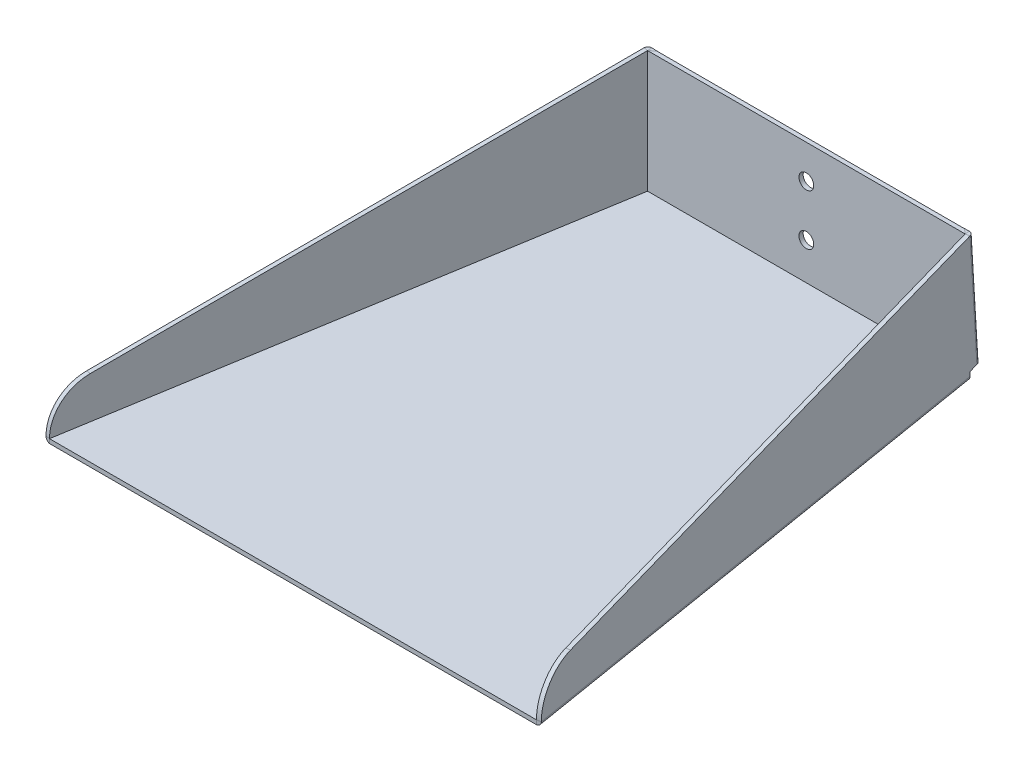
ISO-10303-21;
HEADER;
FILE_DESCRIPTION(('STEP AP214'),'2;1');
FILE_NAME('part.step','',(''),(''),'','','');
FILE_SCHEMA(('AUTOMOTIVE_DESIGN { 1 0 10303 214 1 1 1 1 }'));
ENDSEC;
DATA;
#1=APPLICATION_CONTEXT('core data for automotive mechanical design processes');
#2=APPLICATION_PROTOCOL_DEFINITION('international standard','automotive_design',2000,#1);
#3=PRODUCT_CONTEXT('',#1,'mechanical');
#4=PRODUCT('Part','Part','',(#3));
#5=PRODUCT_RELATED_PRODUCT_CATEGORY('part','',(#4));
#6=PRODUCT_DEFINITION_FORMATION('','',#4);
#7=PRODUCT_DEFINITION_CONTEXT('part definition',#1,'design');
#8=PRODUCT_DEFINITION('design','',#6,#7);
#9=PRODUCT_DEFINITION_SHAPE('','',#8);
#10=(LENGTH_UNIT() NAMED_UNIT(*) SI_UNIT(.MILLI.,.METRE.));
#11=(NAMED_UNIT(*) PLANE_ANGLE_UNIT() SI_UNIT($,.RADIAN.));
#12=(NAMED_UNIT(*) SI_UNIT($,.STERADIAN.) SOLID_ANGLE_UNIT());
#13=UNCERTAINTY_MEASURE_WITH_UNIT(LENGTH_MEASURE(1.E-05),#10,'distance_accuracy_value','');
#14=(GEOMETRIC_REPRESENTATION_CONTEXT(3) GLOBAL_UNCERTAINTY_ASSIGNED_CONTEXT((#13)) GLOBAL_UNIT_ASSIGNED_CONTEXT((#10,
#11,#12)) REPRESENTATION_CONTEXT('',''));
#15=CARTESIAN_POINT('',(0.,0.,0.));
#16=DIRECTION('',(0.,0.,1.));
#17=DIRECTION('',(1.,0.,0.));
#18=AXIS2_PLACEMENT_3D('',#15,#16,#17);
#19=CARTESIAN_POINT('',(1.62756923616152,1.,-9.86666196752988));
#20=DIRECTION('',(0.,1.,0.));
#21=DIRECTION('',(0.,0.,1.));
#22=AXIS2_PLACEMENT_3D('',#19,#20,#21);
#23=PLANE('',#22);
#24=DIRECTION('',(1.,0.,0.));
#25=VECTOR('',#24,1.);
#26=CARTESIAN_POINT('',(0.,1.,0.));
#27=LINE('',#26,#25);
#28=CARTESIAN_POINT('',(0.,1.,0.));
#29=VERTEX_POINT('',#28);
#30=CARTESIAN_POINT('',(115.,1.,0.));
#31=VERTEX_POINT('',#30);
#32=EDGE_CURVE('E455',#29,#31,#27,.T.);
#33=ORIENTED_EDGE('',*,*,#32,.T.);
#34=DIRECTION('',(-0.162756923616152,0.,-0.986666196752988));
#35=VECTOR('',#34,1.);
#36=CARTESIAN_POINT('',(110.412329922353,1.,-27.8114066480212));
#37=LINE('',#36,#35);
#38=CARTESIAN_POINT('',(95.0000000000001,1.,-121.244144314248));
#39=VERTEX_POINT('',#38);
#40=EDGE_CURVE('E746',#31,#39,#37,.T.);
#41=ORIENTED_EDGE('',*,*,#40,.T.);
#42=DIRECTION('',(-1.,0.,0.));
#43=VECTOR('',#42,1.);
#44=CARTESIAN_POINT('',(1.62756923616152,1.,-121.244144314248));
#45=LINE('',#44,#43);
#46=CARTESIAN_POINT('',(20.,1.,-121.244144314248));
#47=VERTEX_POINT('',#46);
#48=EDGE_CURVE('E452',#39,#47,#45,.T.);
#49=ORIENTED_EDGE('',*,*,#48,.T.);
#50=DIRECTION('',(0.162756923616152,0.,-0.986666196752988));
#51=VECTOR('',#50,1.);
#52=CARTESIAN_POINT('',(1.62756923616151,1.,-9.86666196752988));
#53=LINE('',#52,#51);
#54=EDGE_CURVE('E517',#29,#47,#53,.T.);
#55=ORIENTED_EDGE('',*,*,#54,.F.);
#56=EDGE_LOOP('',(#33,#41,#49,#55));
#57=FACE_BOUND('',#56,.T.);
#58=ADVANCED_FACE('F91',(#57),#23,.T.);
#59=CARTESIAN_POINT('',(1.62747056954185,0.999927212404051,-9.86667824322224));
#60=DIRECTION('',(0.986666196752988,0.,0.162756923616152));
#61=DIRECTION('',(-0.160586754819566,-0.162756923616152,0.973510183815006));
#62=AXIS2_PLACEMENT_3D('',#59,#60,#61);
#63=PLANE('',#62);
#64=CARTESIAN_POINT('',(1.62747056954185,0.999927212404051,-9.86667824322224));
#65=DIRECTION('',(0.986666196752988,0.,0.162756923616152));
#66=DIRECTION('',(-0.160586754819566,-0.162756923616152,0.973510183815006));
#67=AXIS2_PLACEMENT_3D('',#64,#65,#66);
#68=CIRCLE('',#67,10.);
#69=CARTESIAN_POINT('',(1.36257240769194,10.8665891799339,-8.26081069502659));
#70=VERTEX_POINT('',#69);
#71=CARTESIAN_POINT('',(-9.86663767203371E-05,1.0001,-1.62771652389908E-05));
#72=VERTEX_POINT('',#71);
#73=EDGE_CURVE('E699',#70,#72,#68,.T.);
#74=ORIENTED_EDGE('',*,*,#73,.T.);
#75=DIRECTION('',(0.162756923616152,0.,-0.986666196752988));
#76=VECTOR('',#75,1.);
#77=CARTESIAN_POINT('',(1.62747056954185,1.0001,-9.86667824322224));
#78=LINE('',#77,#76);
#79=CARTESIAN_POINT('',(19.9999013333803,1.0001,-121.244160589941));
#80=VERTEX_POINT('',#79);
#81=EDGE_CURVE('E769',#72,#80,#78,.T.);
#82=ORIENTED_EDGE('',*,*,#81,.T.);
#83=DIRECTION('',(0.,1.,0.));
#84=VECTOR('',#83,1.);
#85=CARTESIAN_POINT('',(19.9999013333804,2.01344120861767,-121.244160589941));
#86=LINE('',#85,#84);
#87=CARTESIAN_POINT('',(19.9999013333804,2.01344120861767,-121.244160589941));
#88=VERTEX_POINT('',#87);
#89=EDGE_CURVE('E666',#80,#88,#86,.T.);
#90=ORIENTED_EDGE('',*,*,#89,.T.);
#91=DIRECTION('',(0.160586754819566,0.162756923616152,-0.973510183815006));
#92=VECTOR('',#91,1.);
#93=CARTESIAN_POINT('',(19.9999013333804,2.01344120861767,-121.244160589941));
#94=LINE('',#93,#92);
#95=CARTESIAN_POINT('',(20.3210748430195,2.33895505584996,-123.191180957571));
#96=VERTEX_POINT('',#95);
#97=EDGE_CURVE('E700',#88,#96,#94,.T.);
#98=ORIENTED_EDGE('',*,*,#97,.T.);
#99=DIRECTION('',(-0.0116842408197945,0.997419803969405,0.0708322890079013));
#100=VECTOR('',#99,1.);
#101=CARTESIAN_POINT('',(20.2403381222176,9.23100781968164,-122.701738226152));
#102=LINE('',#101,#100);
#103=CARTESIAN_POINT('',(19.9999013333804,29.7557828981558,-121.24416058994));
#104=VERTEX_POINT('',#103);
#105=EDGE_CURVE('E686',#96,#104,#102,.T.);
#106=ORIENTED_EDGE('',*,*,#105,.T.);
#107=DIRECTION('',(-0.160586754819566,-0.162756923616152,0.973510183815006));
#108=VECTOR('',#107,1.);
#109=CARTESIAN_POINT('',(1.36257240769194,10.8665891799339,-8.26081069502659));
#110=LINE('',#109,#108);
#111=EDGE_CURVE('E697',#104,#70,#110,.T.);
#112=ORIENTED_EDGE('',*,*,#111,.T.);
#113=EDGE_LOOP('',(#74,#82,#90,#98,#106,#112));
#114=FACE_BOUND('',#113,.T.);
#115=ADVANCED_FACE('F723',(#114),#63,.T.);
#116=CARTESIAN_POINT('',(0.640804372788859,0.999927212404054,-10.0294351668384));
#117=DIRECTION('',(0.986666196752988,0.,0.162756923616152));
#118=DIRECTION('',(-0.160586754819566,-0.162756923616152,0.973510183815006));
#119=AXIS2_PLACEMENT_3D('',#116,#117,#118);
#120=PLANE('',#119);
#121=DIRECTION('',(0.162756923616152,0.,-0.986666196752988));
#122=VECTOR('',#121,1.);
#123=CARTESIAN_POINT('',(0.640804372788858,1.0001,-10.0294351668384));
#124=LINE('',#123,#122);
#125=CARTESIAN_POINT('',(-0.986764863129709,1.00009999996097,-0.162773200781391));
#126=VERTEX_POINT('',#125);
#127=CARTESIAN_POINT('',(19.0132351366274,1.00010000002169,-121.406917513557));
#128=VERTEX_POINT('',#127);
#129=EDGE_CURVE('E765',#126,#128,#124,.T.);
#130=ORIENTED_EDGE('',*,*,#129,.F.);
#131=CARTESIAN_POINT('',(0.640804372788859,0.999927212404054,-10.0294351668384));
#132=DIRECTION('',(0.986666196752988,0.,0.162756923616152));
#133=DIRECTION('',(-0.160586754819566,-0.162756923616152,0.973510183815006));
#134=AXIS2_PLACEMENT_3D('',#131,#132,#133);
#135=CIRCLE('',#134,10.);
#136=CARTESIAN_POINT('',(0.375906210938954,10.8665891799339,-8.42356761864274));
#137=VERTEX_POINT('',#136);
#138=EDGE_CURVE('E672',#137,#126,#135,.T.);
#139=ORIENTED_EDGE('',*,*,#138,.F.);
#140=DIRECTION('',(-0.160586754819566,-0.162756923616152,0.973510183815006));
#141=VECTOR('',#140,1.);
#142=CARTESIAN_POINT('',(0.375906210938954,10.8665891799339,-8.42356761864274));
#143=LINE('',#142,#141);
#144=CARTESIAN_POINT('',(19.0132351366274,29.7557828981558,-121.406917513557));
#145=VERTEX_POINT('',#144);
#146=EDGE_CURVE('E671',#145,#137,#143,.T.);
#147=ORIENTED_EDGE('',*,*,#146,.F.);
#148=DIRECTION('',(-0.0116842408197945,0.997419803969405,0.0708322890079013));
#149=VECTOR('',#148,1.);
#150=CARTESIAN_POINT('',(19.2536719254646,9.23100781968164,-122.864495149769));
#151=LINE('',#150,#149);
#152=CARTESIAN_POINT('',(19.3344086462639,2.33895505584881,-123.353937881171));
#153=VERTEX_POINT('',#152);
#154=EDGE_CURVE('E673',#153,#145,#151,.T.);
#155=ORIENTED_EDGE('',*,*,#154,.F.);
#156=DIRECTION('',(0.160586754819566,0.162756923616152,-0.973510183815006));
#157=VECTOR('',#156,1.);
#158=CARTESIAN_POINT('',(19.0132351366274,2.01344120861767,-121.406917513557));
#159=LINE('',#158,#157);
#160=CARTESIAN_POINT('',(19.0132351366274,2.01344120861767,-121.406917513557));
#161=VERTEX_POINT('',#160);
#162=EDGE_CURVE('E667',#161,#153,#159,.T.);
#163=ORIENTED_EDGE('',*,*,#162,.F.);
#164=DIRECTION('',(0.,1.,0.));
#165=VECTOR('',#164,1.);
#166=CARTESIAN_POINT('',(19.0132351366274,2.01344120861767,-121.406917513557));
#167=LINE('',#166,#165);
#168=EDGE_CURVE('E694',#128,#161,#167,.T.);
#169=ORIENTED_EDGE('',*,*,#168,.F.);
#170=EDGE_LOOP('',(#130,#139,#147,#155,#163,#169));
#171=FACE_BOUND('',#170,.T.);
#172=ADVANCED_FACE('F726',(#171),#120,.F.);
#173=CARTESIAN_POINT('',(1.62747056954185,0.999927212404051,-9.86667824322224));
#174=DIRECTION('',(-0.986666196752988,0.,-0.162756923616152));
#175=DIRECTION('',(0.160586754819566,0.162756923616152,-0.973510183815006));
#176=AXIS2_PLACEMENT_3D('',#173,#174,#175);
#177=CYLINDRICAL_SURFACE('',#176,10.);
#178=DIRECTION('',(-0.986666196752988,0.,-0.162756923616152));
#179=VECTOR('',#178,1.);
#180=CARTESIAN_POINT('',(-9.8666376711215E-05,1.0001,-1.62771652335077E-05));
#181=LINE('',#180,#179);
#182=EDGE_CURVE('E767',#72,#126,#181,.T.);
#183=ORIENTED_EDGE('',*,*,#182,.F.);
#184=ORIENTED_EDGE('',*,*,#73,.F.);
#185=DIRECTION('',(-0.986666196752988,0.,-0.162756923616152));
#186=VECTOR('',#185,1.);
#187=CARTESIAN_POINT('',(1.36257240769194,10.8665891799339,-8.26081069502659));
#188=LINE('',#187,#186);
#189=EDGE_CURVE('E668',#70,#137,#188,.T.);
#190=ORIENTED_EDGE('',*,*,#189,.T.);
#191=ORIENTED_EDGE('',*,*,#138,.T.);
#192=EDGE_LOOP('',(#183,#184,#190,#191));
#193=FACE_BOUND('',#192,.T.);
#194=ADVANCED_FACE('F728',(#193),#177,.T.);
#195=CARTESIAN_POINT('',(1.36257240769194,10.8665891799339,-8.26081069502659));
#196=DIRECTION('',(0.0264898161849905,-0.986666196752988,-0.160586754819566));
#197=DIRECTION('',(0.160586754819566,0.162756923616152,-0.973510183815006));
#198=AXIS2_PLACEMENT_3D('',#195,#196,#197);
#199=PLANE('',#198);
#200=ORIENTED_EDGE('',*,*,#146,.T.);
#201=ORIENTED_EDGE('',*,*,#189,.F.);
#202=ORIENTED_EDGE('',*,*,#111,.F.);
#203=CARTESIAN_POINT('',(19.0132351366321,29.7557828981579,-121.406917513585));
#204=CARTESIAN_POINT('',(19.9999013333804,29.7557828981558,-121.24416058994));
#205=B_SPLINE_CURVE_WITH_KNOTS('',1,(#203,#204),.UNSPECIFIED.,.F.,.F.,(2,2),(0.,1.),.UNSPECIFIED.);
#206=EDGE_CURVE('E654',#104,#145,#205,.F.);
#207=ORIENTED_EDGE('',*,*,#206,.T.);
#208=EDGE_LOOP('',(#200,#201,#202,#207));
#209=FACE_BOUND('',#208,.T.);
#210=ADVANCED_FACE('F613',(#209),#199,.F.);
#211=CARTESIAN_POINT('',(19.9999013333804,2.01344120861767,-121.244160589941));
#212=DIRECTION('',(-0.0264898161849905,0.986666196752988,0.160586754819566));
#213=DIRECTION('',(-0.160586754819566,-0.162756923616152,0.973510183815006));
#214=AXIS2_PLACEMENT_3D('',#211,#212,#213);
#215=PLANE('',#214);
#216=CARTESIAN_POINT('',(20.3210748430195,2.33895505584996,-123.191180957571));
#217=CARTESIAN_POINT('',(19.3344086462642,2.33895505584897,-123.353937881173));
#218=B_SPLINE_CURVE_WITH_KNOTS('',1,(#216,#217),.UNSPECIFIED.,.F.,.F.,(2,2),(0.,1.),.UNSPECIFIED.);
#219=EDGE_CURVE('E640',#96,#153,#218,.T.);
#220=ORIENTED_EDGE('',*,*,#219,.F.);
#221=ORIENTED_EDGE('',*,*,#97,.F.);
#222=DIRECTION('',(-0.986666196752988,0.,-0.162756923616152));
#223=VECTOR('',#222,1.);
#224=CARTESIAN_POINT('',(19.9999013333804,2.01344120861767,-121.244160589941));
#225=LINE('',#224,#223);
#226=EDGE_CURVE('E658',#88,#161,#225,.T.);
#227=ORIENTED_EDGE('',*,*,#226,.T.);
#228=ORIENTED_EDGE('',*,*,#162,.T.);
#229=EDGE_LOOP('',(#220,#221,#227,#228));
#230=FACE_BOUND('',#229,.T.);
#231=ADVANCED_FACE('F714',(#230),#215,.F.);
#232=CARTESIAN_POINT('',(19.9999013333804,2.01344120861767,-121.244160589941));
#233=DIRECTION('',(-0.162756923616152,0.,0.986666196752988));
#234=DIRECTION('',(0.,-1.,0.));
#235=AXIS2_PLACEMENT_3D('',#232,#233,#234);
#236=PLANE('',#235);
#237=DIRECTION('',(0.986666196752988,0.,0.162756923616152));
#238=VECTOR('',#237,1.);
#239=CARTESIAN_POINT('',(19.9999013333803,1.0001,-121.244160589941));
#240=LINE('',#239,#238);
#241=EDGE_CURVE('E754',#128,#80,#240,.T.);
#242=ORIENTED_EDGE('',*,*,#241,.F.);
#243=ORIENTED_EDGE('',*,*,#168,.T.);
#244=ORIENTED_EDGE('',*,*,#226,.F.);
#245=ORIENTED_EDGE('',*,*,#89,.F.);
#246=EDGE_LOOP('',(#242,#243,#244,#245));
#247=FACE_BOUND('',#246,.T.);
#248=ADVANCED_FACE('F609',(#247),#236,.F.);
#249=CARTESIAN_POINT('',(19.3344086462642,2.33895505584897,-123.353937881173));
#250=CARTESIAN_POINT('',(19.3533183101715,2.34732787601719,-123.468572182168));
#251=CARTESIAN_POINT('',(19.3924773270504,2.35569683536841,-123.579810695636));
#252=CARTESIAN_POINT('',(19.5066208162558,2.37143241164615,-123.782261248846));
#253=CARTESIAN_POINT('',(19.5815750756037,2.37879421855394,-123.873410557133));
#254=CARTESIAN_POINT('',(19.7582795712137,2.39162623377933,-124.024650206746));
#255=CARTESIAN_POINT('',(19.8599863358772,2.39709329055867,-124.084703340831));
#256=CARTESIAN_POINT('',(20.0779386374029,2.4054766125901,-124.166490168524));
#257=CARTESIAN_POINT('',(20.1941174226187,2.40839065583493,-124.18820360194));
#258=CARTESIAN_POINT('',(20.3105864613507,2.40985387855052,-124.18943830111));
#259=CARTESIAN_POINT('',(20.3210748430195,2.33895505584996,-123.191180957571));
#260=CARTESIAN_POINT('',(20.3210936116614,2.33897384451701,-123.191294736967));
#261=CARTESIAN_POINT('',(20.3211326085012,2.33899271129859,-123.191405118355));
#262=CARTESIAN_POINT('',(20.3212463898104,2.33902961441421,-123.19160586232));
#263=CARTESIAN_POINT('',(20.3213211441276,2.3390476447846,-123.191696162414));
#264=CARTESIAN_POINT('',(20.3214974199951,2.33908198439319,-123.191845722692));
#265=CARTESIAN_POINT('',(20.3215988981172,2.33909829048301,-123.191904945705));
#266=CARTESIAN_POINT('',(20.3218163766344,2.33912852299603,-123.191985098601));
#267=CARTESIAN_POINT('',(20.3219323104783,2.33914244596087,-123.192006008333));
#268=CARTESIAN_POINT('',(20.322048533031,2.33915500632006,-123.192006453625));
#269=B_SPLINE_SURFACE_WITH_KNOTS('',1,3,((#249,#250,#251,#252,#253,#254,#255,#256,#257,#258),
(#259,#260,#261,#262,#263,#264,#265,#266,#267,#268)),.UNSPECIFIED.,.F.,.F.,.F.,(2,2),(4,2,2,2,
4),(0.,1.),(0.,0.25,0.5,0.75,1.),.UNSPECIFIED.);
#270=CARTESIAN_POINT('',(19.3344086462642,2.33895505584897,-123.353937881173));
#271=CARTESIAN_POINT('',(19.3533183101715,2.34732787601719,-123.468572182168));
#272=CARTESIAN_POINT('',(19.3924773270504,2.35569683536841,-123.579810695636));
#273=CARTESIAN_POINT('',(19.5066208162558,2.37143241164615,-123.782261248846));
#274=CARTESIAN_POINT('',(19.5815750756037,2.37879421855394,-123.873410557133));
#275=CARTESIAN_POINT('',(19.7582795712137,2.39162623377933,-124.024650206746));
#276=CARTESIAN_POINT('',(19.8599863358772,2.39709329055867,-124.084703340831));
#277=CARTESIAN_POINT('',(20.0779386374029,2.4054766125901,-124.166490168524));
#278=CARTESIAN_POINT('',(20.1941174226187,2.40839065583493,-124.18820360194));
#279=CARTESIAN_POINT('',(20.3105864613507,2.40985387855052,-124.18943830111));
#280=B_SPLINE_CURVE_WITH_KNOTS('',3,(#270,#271,#272,#273,#274,#275,#276,#277,#278,#279),
.UNSPECIFIED.,.F.,.F.,(4,2,2,2,4),(0.,0.25,0.5,0.75,1.),.UNSPECIFIED.);
#281=CARTESIAN_POINT('',(20.3105864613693,2.40985387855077,-124.18943830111));
#282=VERTEX_POINT('',#281);
#283=EDGE_CURVE('E522',#153,#282,#280,.T.);
#284=CARTESIAN_POINT('',(20.3105864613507,2.40985387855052,-124.18943830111));
#285=CARTESIAN_POINT('',(20.322048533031,2.33915500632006,-123.192006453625));
#286=B_SPLINE_CURVE_WITH_KNOTS('',1,(#284,#285),.UNSPECIFIED.,.F.,.F.,(2,2),(0.,1.),.UNSPECIFIED.);
#287=CARTESIAN_POINT('',(20.322048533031,2.33915500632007,-123.192006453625));
#288=VERTEX_POINT('',#287);
#289=EDGE_CURVE('E794',#288,#282,#286,.F.);
#290=CARTESIAN_POINT('',(20.322048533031,2.33915500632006,-123.192006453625));
#291=CARTESIAN_POINT('',(20.3219323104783,2.33914244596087,-123.192006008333));
#292=CARTESIAN_POINT('',(20.3218163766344,2.33912852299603,-123.191985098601));
#293=CARTESIAN_POINT('',(20.3215988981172,2.33909829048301,-123.191904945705));
#294=CARTESIAN_POINT('',(20.3214974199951,2.33908198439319,-123.191845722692));
#295=CARTESIAN_POINT('',(20.3213211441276,2.3390476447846,-123.191696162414));
#296=CARTESIAN_POINT('',(20.3212463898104,2.33902961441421,-123.19160586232));
#297=CARTESIAN_POINT('',(20.3211326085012,2.33899271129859,-123.191405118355));
#298=CARTESIAN_POINT('',(20.3210936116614,2.33897384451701,-123.191294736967));
#299=CARTESIAN_POINT('',(20.3210748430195,2.33895505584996,-123.191180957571));
#300=B_SPLINE_CURVE_WITH_KNOTS('',3,(#290,#291,#292,#293,#294,#295,#296,#297,#298,#299),
.UNSPECIFIED.,.F.,.F.,(4,2,2,2,4),(0.,0.25,0.5,0.75,1.),.UNSPECIFIED.);
#301=EDGE_CURVE('E575',#96,#288,#300,.F.);
#302=ORIENTED_EDGE('',*,*,#219,.T.);
#303=ORIENTED_EDGE('',*,*,#283,.T.);
#304=ORIENTED_EDGE('',*,*,#289,.F.);
#305=ORIENTED_EDGE('',*,*,#301,.F.);
#306=EDGE_LOOP('',(#302,#303,#304,#305));
#307=FACE_BOUND('',#306,.T.);
#308=ADVANCED_FACE('F598',(#307),#269,.F.);
#309=CARTESIAN_POINT('',(19.9894156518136,29.8264512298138,-122.242434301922));
#310=CARTESIAN_POINT('',(19.8729463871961,29.8250072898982,-122.241198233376));
#311=CARTESIAN_POINT('',(19.7567673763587,29.8221125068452,-122.219483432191));
#312=CARTESIAN_POINT('',(19.5388146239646,29.8137676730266,-122.137693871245));
#313=CARTESIAN_POINT('',(19.437107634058,29.8083198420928,-122.077639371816));
#314=CARTESIAN_POINT('',(19.2604026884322,29.7955262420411,-121.926396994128));
#315=CARTESIAN_POINT('',(19.1854482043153,29.7881836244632,-121.835246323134));
#316=CARTESIAN_POINT('',(19.0713042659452,29.7724863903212,-121.632793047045));
#317=CARTESIAN_POINT('',(19.0321450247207,29.7641365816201,-121.521553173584));
#318=CARTESIAN_POINT('',(19.0132351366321,29.7557828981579,-121.406917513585));
#319=CARTESIAN_POINT('',(20.0008777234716,29.7557523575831,-121.245002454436));
#320=CARTESIAN_POINT('',(20.0007612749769,29.755759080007,-121.245000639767));
#321=CARTESIAN_POINT('',(20.0006451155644,29.7557644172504,-121.244978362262));
#322=CARTESIAN_POINT('',(20.0004271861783,29.7557726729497,-121.244895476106));
#323=CARTESIAN_POINT('',(20.0003254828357,29.7557755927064,-121.244834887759));
#324=CARTESIAN_POINT('',(20.0001487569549,29.7557796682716,-121.244682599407));
#325=CARTESIAN_POINT('',(20.0000737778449,29.7557808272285,-121.244590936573));
#326=CARTESIAN_POINT('',(19.9999595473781,29.7557822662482,-121.244387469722));
#327=CARTESIAN_POINT('',(19.9999203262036,29.755782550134,-121.24427572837));
#328=CARTESIAN_POINT('',(19.9999013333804,29.7557828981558,-121.24416058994));
#329=B_SPLINE_SURFACE_WITH_KNOTS('',1,3,((#309,#310,#311,#312,#313,#314,#315,#316,#317,#318),
(#319,#320,#321,#322,#323,#324,#325,#326,#327,#328)),.UNSPECIFIED.,.F.,.F.,.F.,(2,2),(4,2,2,2,
4),(0.,1.),(0.,0.25,0.5,0.75,1.),.UNSPECIFIED.);
#330=CARTESIAN_POINT('',(20.0008777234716,29.7557523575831,-121.245002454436));
#331=CARTESIAN_POINT('',(19.9894156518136,29.8264512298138,-122.242434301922));
#332=B_SPLINE_CURVE_WITH_KNOTS('',1,(#330,#331),.UNSPECIFIED.,.F.,.F.,(2,2),(0.,1.),.UNSPECIFIED.);
#333=CARTESIAN_POINT('',(19.9894156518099,29.8264512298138,-122.242434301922));
#334=VERTEX_POINT('',#333);
#335=CARTESIAN_POINT('',(20.0008777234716,29.7557523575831,-121.245002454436));
#336=VERTEX_POINT('',#335);
#337=EDGE_CURVE('E523',#334,#336,#332,.F.);
#338=CARTESIAN_POINT('',(19.9894156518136,29.8264512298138,-122.242434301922));
#339=CARTESIAN_POINT('',(19.8729463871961,29.8250072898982,-122.241198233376));
#340=CARTESIAN_POINT('',(19.7567673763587,29.8221125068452,-122.219483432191));
#341=CARTESIAN_POINT('',(19.5388146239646,29.8137676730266,-122.137693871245));
#342=CARTESIAN_POINT('',(19.437107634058,29.8083198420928,-122.077639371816));
#343=CARTESIAN_POINT('',(19.2604026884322,29.7955262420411,-121.926396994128));
#344=CARTESIAN_POINT('',(19.1854482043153,29.7881836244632,-121.835246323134));
#345=CARTESIAN_POINT('',(19.0713042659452,29.7724863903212,-121.632793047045));
#346=CARTESIAN_POINT('',(19.0321450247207,29.7641365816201,-121.521553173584));
#347=CARTESIAN_POINT('',(19.0132351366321,29.7557828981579,-121.406917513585));
#348=B_SPLINE_CURVE_WITH_KNOTS('',3,(#338,#339,#340,#341,#342,#343,#344,#345,#346,#347),
.UNSPECIFIED.,.F.,.F.,(4,2,2,2,4),(0.,0.25,0.5,0.75,1.),.UNSPECIFIED.);
#349=EDGE_CURVE('E829',#334,#145,#348,.T.);
#350=CARTESIAN_POINT('',(19.9999013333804,29.7557828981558,-121.24416058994));
#351=CARTESIAN_POINT('',(19.9999203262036,29.755782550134,-121.24427572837));
#352=CARTESIAN_POINT('',(19.9999595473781,29.7557822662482,-121.244387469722));
#353=CARTESIAN_POINT('',(20.0000737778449,29.7557808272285,-121.244590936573));
#354=CARTESIAN_POINT('',(20.0001487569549,29.7557796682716,-121.244682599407));
#355=CARTESIAN_POINT('',(20.0003254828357,29.7557755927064,-121.244834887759));
#356=CARTESIAN_POINT('',(20.0004271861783,29.7557726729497,-121.244895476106));
#357=CARTESIAN_POINT('',(20.0006451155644,29.7557644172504,-121.244978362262));
#358=CARTESIAN_POINT('',(20.0007612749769,29.755759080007,-121.245000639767));
#359=CARTESIAN_POINT('',(20.0008777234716,29.7557523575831,-121.245002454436));
#360=B_SPLINE_CURVE_WITH_KNOTS('',3,(#350,#351,#352,#353,#354,#355,#356,#357,#358,#359),
.UNSPECIFIED.,.F.,.F.,(4,2,2,2,4),(0.,0.25,0.5,0.75,1.),.UNSPECIFIED.);
#361=EDGE_CURVE('E762',#336,#104,#360,.F.);
#362=ORIENTED_EDGE('',*,*,#337,.F.);
#363=ORIENTED_EDGE('',*,*,#349,.T.);
#364=ORIENTED_EDGE('',*,*,#206,.F.);
#365=ORIENTED_EDGE('',*,*,#361,.F.);
#366=EDGE_LOOP('',(#362,#363,#364,#365));
#367=FACE_BOUND('',#366,.T.);
#368=ADVANCED_FACE('F550',(#367),#329,.F.);
#369=CARTESIAN_POINT('',(20.4828622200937,-11.3877231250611,-124.165825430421));
#370=DIRECTION('',(-0.0116842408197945,0.997419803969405,0.0708322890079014));
#371=DIRECTION('',(-0.162336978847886,-0.0717895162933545,0.984120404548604));
#372=AXIS2_PLACEMENT_3D('',#369,#370,#371);
#373=CYLINDRICAL_SURFACE('',#372,0.001);
#374=ORIENTED_EDGE('',*,*,#361,.T.);
#375=ORIENTED_EDGE('',*,*,#105,.F.);
#376=ORIENTED_EDGE('',*,*,#301,.T.);
#377=DIRECTION('',(-0.0116842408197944,0.997419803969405,0.0708322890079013));
#378=VECTOR('',#377,1.);
#379=CARTESIAN_POINT('',(20.2413133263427,9.23107851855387,-122.702572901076));
#380=LINE('',#379,#378);
#381=EDGE_CURVE('E445',#288,#336,#380,.T.);
#382=ORIENTED_EDGE('',*,*,#381,.T.);
#383=EDGE_LOOP('',(#374,#375,#376,#382));
#384=FACE_BOUND('',#383,.T.);
#385=ADVANCED_FACE('F539',(#384),#373,.F.);
#386=CARTESIAN_POINT('',(20.4828622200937,-11.3877231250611,-124.165825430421));
#387=DIRECTION('',(-0.0116842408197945,0.997419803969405,0.0708322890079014));
#388=DIRECTION('',(-0.162336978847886,-0.0717895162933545,0.984120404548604));
#389=AXIS2_PLACEMENT_3D('',#386,#387,#388);
#390=CYLINDRICAL_SURFACE('',#389,1.001);
#391=ORIENTED_EDGE('',*,*,#349,.F.);
#392=DIRECTION('',(-0.0116842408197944,0.997419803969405,0.0708322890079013));
#393=VECTOR('',#392,1.);
#394=CARTESIAN_POINT('',(20.2298512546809,9.30177739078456,-123.700004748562));
#395=LINE('',#394,#393);
#396=EDGE_CURVE('E789',#282,#334,#395,.T.);
#397=ORIENTED_EDGE('',*,*,#396,.F.);
#398=ORIENTED_EDGE('',*,*,#283,.F.);
#399=ORIENTED_EDGE('',*,*,#154,.T.);
#400=EDGE_LOOP('',(#391,#397,#398,#399));
#401=FACE_BOUND('',#400,.T.);
#402=ADVANCED_FACE('F549',(#401),#390,.T.);
#403=CARTESIAN_POINT('',(44.9525914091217,28.2765777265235,-121.636582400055));
#404=DIRECTION('',(-0.996897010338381,-0.0784960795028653,0.00589205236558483));
#405=DIRECTION('',(0.0778779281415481,-0.994404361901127,-0.0713792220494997));
#406=AXIS2_PLACEMENT_3D('',#403,#404,#405);
#407=PLANE('',#406);
#408=DIRECTION('',(-0.0778779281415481,0.994404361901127,0.0713792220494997));
#409=VECTOR('',#408,1.);
#410=CARTESIAN_POINT('',(44.94112933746,28.3472765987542,-122.63401424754));
#411=LINE('',#410,#409);
#412=CARTESIAN_POINT('',(46.7565417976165,5.16671553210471,-124.297935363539));
#413=VERTEX_POINT('',#412);
#414=CARTESIAN_POINT('',(44.94112933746,28.3472765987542,-122.63401424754));
#415=VERTEX_POINT('',#414);
#416=EDGE_CURVE('E531',#413,#415,#411,.T.);
#417=ORIENTED_EDGE('',*,*,#416,.T.);
#418=DIRECTION('',(-0.0114620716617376,0.0706988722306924,-0.997431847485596));
#419=VECTOR('',#418,1.);
#420=CARTESIAN_POINT('',(44.9525914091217,28.2765777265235,-121.636582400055));
#421=LINE('',#420,#419);
#422=CARTESIAN_POINT('',(44.9525914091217,28.2765777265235,-121.636582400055));
#423=VERTEX_POINT('',#422);
#424=EDGE_CURVE('E519',#423,#415,#421,.T.);
#425=ORIENTED_EDGE('',*,*,#424,.F.);
#426=DIRECTION('',(-0.0778779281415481,0.994404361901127,0.0713792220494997));
#427=VECTOR('',#426,1.);
#428=CARTESIAN_POINT('',(44.9525914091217,28.2765777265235,-121.636582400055));
#429=LINE('',#428,#427);
#430=CARTESIAN_POINT('',(46.7680038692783,5.09601665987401,-123.300503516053));
#431=VERTEX_POINT('',#430);
#432=EDGE_CURVE('E524',#431,#423,#429,.T.);
#433=ORIENTED_EDGE('',*,*,#432,.F.);
#434=DIRECTION('',(-0.0114620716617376,0.0706988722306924,-0.997431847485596));
#435=VECTOR('',#434,1.);
#436=CARTESIAN_POINT('',(46.7680038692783,5.09601665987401,-123.300503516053));
#437=LINE('',#436,#435);
#438=EDGE_CURVE('E528',#431,#413,#437,.T.);
#439=ORIENTED_EDGE('',*,*,#438,.T.);
#440=EDGE_LOOP('',(#417,#425,#433,#439));
#441=FACE_BOUND('',#440,.T.);
#442=ADVANCED_FACE('F881',(#441),#407,.F.);
#443=CARTESIAN_POINT('',(-94.4004843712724,7.80174879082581,-121.48646926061));
#444=DIRECTION('',(0.0114620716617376,-0.0706988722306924,0.997431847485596));
#445=DIRECTION('',(-0.994602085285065,-0.103682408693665,0.00408045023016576));
#446=AXIS2_PLACEMENT_3D('',#443,#444,#445);
#447=PLANE('',#446);
#448=ORIENTED_EDGE('',*,*,#381,.F.);
#449=DIRECTION('',(0.994602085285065,0.103682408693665,-0.00408045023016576));
#450=VECTOR('',#449,1.);
#451=CARTESIAN_POINT('',(18.3314358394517,2.13164335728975,-123.183839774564));
#452=LINE('',#451,#450);
#453=EDGE_CURVE('E527',#288,#431,#452,.T.);
#454=ORIENTED_EDGE('',*,*,#453,.T.);
#455=ORIENTED_EDGE('',*,*,#432,.T.);
#456=DIRECTION('',(-0.99812499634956,0.0591703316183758,0.015664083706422));
#457=VECTOR('',#456,1.);
#458=CARTESIAN_POINT('',(19.9994665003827,29.7558360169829,-121.244980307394));
#459=LINE('',#458,#457);
#460=EDGE_CURVE('E526',#423,#336,#459,.T.);
#461=ORIENTED_EDGE('',*,*,#460,.T.);
#462=EDGE_LOOP('',(#448,#454,#455,#461));
#463=FACE_BOUND('',#462,.T.);
#464=ADVANCED_FACE('F815',(#463),#447,.T.);
#465=CARTESIAN_POINT('',(18.3314358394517,2.13164335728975,-123.183839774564));
#466=DIRECTION('',(-0.103127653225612,0.992094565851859,0.0715056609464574));
#467=DIRECTION('',(-0.994602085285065,-0.103682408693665,0.00408045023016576));
#468=AXIS2_PLACEMENT_3D('',#465,#466,#467);
#469=PLANE('',#468);
#470=ORIENTED_EDGE('',*,*,#453,.F.);
#471=ORIENTED_EDGE('',*,*,#289,.T.);
#472=DIRECTION('',(0.994602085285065,0.103682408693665,-0.00408045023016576));
#473=VECTOR('',#472,1.);
#474=CARTESIAN_POINT('',(18.3199737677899,2.20234222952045,-124.18127162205));
#475=LINE('',#474,#473);
#476=EDGE_CURVE('E792',#282,#413,#475,.T.);
#477=ORIENTED_EDGE('',*,*,#476,.T.);
#478=ORIENTED_EDGE('',*,*,#438,.F.);
#479=EDGE_LOOP('',(#470,#471,#477,#478));
#480=FACE_BOUND('',#479,.T.);
#481=ADVANCED_FACE('F805',(#480),#469,.F.);
#482=CARTESIAN_POINT('',(-94.4119464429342,7.8724476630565,-122.483901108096));
#483=DIRECTION('',(0.0114620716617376,-0.0706988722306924,0.997431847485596));
#484=DIRECTION('',(-0.994602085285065,-0.103682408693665,0.00408045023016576));
#485=AXIS2_PLACEMENT_3D('',#482,#483,#484);
#486=PLANE('',#485);
#487=ORIENTED_EDGE('',*,*,#476,.F.);
#488=ORIENTED_EDGE('',*,*,#396,.T.);
#489=DIRECTION('',(-0.99812499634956,0.0591703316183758,0.015664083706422));
#490=VECTOR('',#489,1.);
#491=CARTESIAN_POINT('',(19.988004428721,29.8265348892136,-122.24241215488));
#492=LINE('',#491,#490);
#493=EDGE_CURVE('E787',#415,#334,#492,.T.);
#494=ORIENTED_EDGE('',*,*,#493,.F.);
#495=ORIENTED_EDGE('',*,*,#416,.F.);
#496=EDGE_LOOP('',(#487,#488,#494,#495));
#497=FACE_BOUND('',#496,.T.);
#498=ADVANCED_FACE('F814',(#497),#486,.F.);
#499=CARTESIAN_POINT('',(19.9994665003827,29.7558360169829,-121.244980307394));
#500=DIRECTION('',(-0.0601258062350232,-0.995741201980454,-0.0698880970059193));
#501=DIRECTION('',(0.998124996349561,-0.0591703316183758,-0.015664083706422));
#502=AXIS2_PLACEMENT_3D('',#499,#500,#501);
#503=PLANE('',#502);
#504=ORIENTED_EDGE('',*,*,#493,.T.);
#505=ORIENTED_EDGE('',*,*,#337,.T.);
#506=ORIENTED_EDGE('',*,*,#460,.F.);
#507=ORIENTED_EDGE('',*,*,#424,.T.);
#508=EDGE_LOOP('',(#504,#505,#506,#507));
#509=FACE_BOUND('',#508,.T.);
#510=ADVANCED_FACE('F552',(#509),#503,.F.);
#511=CARTESIAN_POINT('',(57.5,9.75578289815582,-121.244244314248));
#512=DIRECTION('',(0.,0.,-1.));
#513=DIRECTION('',(0.,1.,0.));
#514=AXIS2_PLACEMENT_3D('',#511,#512,#513);
#515=CYLINDRICAL_SURFACE('',#514,1.75);
#516=CARTESIAN_POINT('',(57.5,9.75578289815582,-121.244244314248));
#517=DIRECTION('',(0.,0.,1.));
#518=DIRECTION('',(0.,-1.,0.));
#519=AXIS2_PLACEMENT_3D('',#516,#517,#518);
#520=CIRCLE('',#519,1.75);
#521=CARTESIAN_POINT('',(57.5,8.00578289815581,-121.244244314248));
#522=VERTEX_POINT('',#521);
#523=EDGE_CURVE('E512',#522,#522,#520,.T.);
#524=ORIENTED_EDGE('',*,*,#523,.T.);
#525=EDGE_LOOP('',(#524));
#526=FACE_BOUND('',#525,.T.);
#527=CARTESIAN_POINT('',(57.5,9.75578289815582,-122.244244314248));
#528=DIRECTION('',(0.,0.,1.));
#529=DIRECTION('',(0.,-1.,0.));
#530=AXIS2_PLACEMENT_3D('',#527,#528,#529);
#531=CIRCLE('',#530,1.75);
#532=CARTESIAN_POINT('',(57.5,8.00578289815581,-122.244244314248));
#533=VERTEX_POINT('',#532);
#534=EDGE_CURVE('E493',#533,#533,#531,.T.);
#535=ORIENTED_EDGE('',*,*,#534,.F.);
#536=EDGE_LOOP('',(#535));
#537=FACE_BOUND('',#536,.T.);
#538=ADVANCED_FACE('F823',(#526,#537),#515,.F.);
#539=CARTESIAN_POINT('',(57.5,21.7557828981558,-121.244244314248));
#540=DIRECTION('',(0.,0.,-1.));
#541=DIRECTION('',(0.,1.,0.));
#542=AXIS2_PLACEMENT_3D('',#539,#540,#541);
#543=CYLINDRICAL_SURFACE('',#542,1.75);
#544=CARTESIAN_POINT('',(57.5,21.7557828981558,-121.244244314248));
#545=DIRECTION('',(0.,0.,1.));
#546=DIRECTION('',(0.,-1.,0.));
#547=AXIS2_PLACEMENT_3D('',#544,#545,#546);
#548=CIRCLE('',#547,1.75);
#549=CARTESIAN_POINT('',(57.5,20.0057828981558,-121.244244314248));
#550=VERTEX_POINT('',#549);
#551=EDGE_CURVE('E509',#550,#550,#548,.T.);
#552=ORIENTED_EDGE('',*,*,#551,.T.);
#553=EDGE_LOOP('',(#552));
#554=FACE_BOUND('',#553,.T.);
#555=CARTESIAN_POINT('',(57.5,21.7557828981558,-122.244244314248));
#556=DIRECTION('',(0.,0.,1.));
#557=DIRECTION('',(0.,-1.,0.));
#558=AXIS2_PLACEMENT_3D('',#555,#556,#557);
#559=CIRCLE('',#558,1.75);
#560=CARTESIAN_POINT('',(57.5,20.0057828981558,-122.244244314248));
#561=VERTEX_POINT('',#560);
#562=EDGE_CURVE('E496',#561,#561,#559,.T.);
#563=ORIENTED_EDGE('',*,*,#562,.F.);
#564=EDGE_LOOP('',(#563));
#565=FACE_BOUND('',#564,.T.);
#566=ADVANCED_FACE('F1339',(#554,#565),#543,.F.);
#567=CARTESIAN_POINT('',(95.,0.99992721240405,-121.244244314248));
#568=DIRECTION('',(-1.,0.,0.));
#569=DIRECTION('',(0.,-1.,0.));
#570=AXIS2_PLACEMENT_3D('',#567,#568,#569);
#571=PLANE('',#570);
#572=DIRECTION('',(0.,1.,0.));
#573=VECTOR('',#572,1.);
#574=CARTESIAN_POINT('',(95.,0.99992721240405,-121.244244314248));
#575=LINE('',#574,#573);
#576=CARTESIAN_POINT('',(95.,1.0001,-121.244244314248));
#577=VERTEX_POINT('',#576);
#578=CARTESIAN_POINT('',(95.,29.7557828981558,-121.244244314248));
#579=VERTEX_POINT('',#578);
#580=EDGE_CURVE('E488',#577,#579,#575,.T.);
#581=ORIENTED_EDGE('',*,*,#580,.F.);
#582=DIRECTION('',(0.,0.,-1.));
#583=VECTOR('',#582,1.);
#584=CARTESIAN_POINT('',(95.,1.0001,-121.244244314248));
#585=LINE('',#584,#583);
#586=CARTESIAN_POINT('',(95.,1.0001,-122.244244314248));
#587=VERTEX_POINT('',#586);
#588=EDGE_CURVE('E506',#577,#587,#585,.T.);
#589=ORIENTED_EDGE('',*,*,#588,.T.);
#590=DIRECTION('',(0.,1.,0.));
#591=VECTOR('',#590,1.);
#592=CARTESIAN_POINT('',(95.,0.99992721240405,-122.244244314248));
#593=LINE('',#592,#591);
#594=CARTESIAN_POINT('',(95.,29.7557828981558,-122.244244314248));
#595=VERTEX_POINT('',#594);
#596=EDGE_CURVE('E504',#587,#595,#593,.T.);
#597=ORIENTED_EDGE('',*,*,#596,.T.);
#598=DIRECTION('',(0.,0.,-1.));
#599=VECTOR('',#598,1.);
#600=CARTESIAN_POINT('',(95.,29.7557828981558,-121.244244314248));
#601=LINE('',#600,#599);
#602=EDGE_CURVE('E499',#579,#595,#601,.T.);
#603=ORIENTED_EDGE('',*,*,#602,.F.);
#604=EDGE_LOOP('',(#581,#589,#597,#603));
#605=FACE_BOUND('',#604,.T.);
#606=ADVANCED_FACE('F1254',(#605),#571,.F.);
#607=CARTESIAN_POINT('',(95.,29.7557828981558,-121.244244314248));
#608=DIRECTION('',(0.,-1.,0.));
#609=DIRECTION('',(1.,0.,0.));
#610=AXIS2_PLACEMENT_3D('',#607,#608,#609);
#611=PLANE('',#610);
#612=DIRECTION('',(-1.,0.,0.));
#613=VECTOR('',#612,1.);
#614=CARTESIAN_POINT('',(95.,29.7557828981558,-122.244244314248));
#615=LINE('',#614,#613);
#616=CARTESIAN_POINT('',(20.,29.7557828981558,-122.244244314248));
#617=VERTEX_POINT('',#616);
#618=EDGE_CURVE('E502',#595,#617,#615,.T.);
#619=ORIENTED_EDGE('',*,*,#618,.T.);
#620=DIRECTION('',(0.,0.,-1.));
#621=VECTOR('',#620,1.);
#622=CARTESIAN_POINT('',(20.,29.7557828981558,-121.244244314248));
#623=LINE('',#622,#621);
#624=CARTESIAN_POINT('',(20.,29.7557828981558,-121.244244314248));
#625=VERTEX_POINT('',#624);
#626=EDGE_CURVE('E473',#625,#617,#623,.T.);
#627=ORIENTED_EDGE('',*,*,#626,.F.);
#628=DIRECTION('',(-1.,0.,0.));
#629=VECTOR('',#628,1.);
#630=CARTESIAN_POINT('',(95.,29.7557828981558,-121.244244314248));
#631=LINE('',#630,#629);
#632=EDGE_CURVE('E486',#579,#625,#631,.T.);
#633=ORIENTED_EDGE('',*,*,#632,.F.);
#634=ORIENTED_EDGE('',*,*,#602,.T.);
#635=EDGE_LOOP('',(#619,#627,#633,#634));
#636=FACE_BOUND('',#635,.T.);
#637=ADVANCED_FACE('F1259',(#636),#611,.F.);
#638=CARTESIAN_POINT('',(1.62756923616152,-110.377555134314,-122.244244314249));
#639=DIRECTION('',(0.,0.,1.));
#640=DIRECTION('',(0.,-1.,0.));
#641=AXIS2_PLACEMENT_3D('',#638,#639,#640);
#642=PLANE('',#641);
#643=ORIENTED_EDGE('',*,*,#562,.T.);
#644=EDGE_LOOP('',(#643));
#645=FACE_BOUND('',#644,.T.);
#646=ORIENTED_EDGE('',*,*,#534,.T.);
#647=EDGE_LOOP('',(#646));
#648=FACE_BOUND('',#647,.T.);
#649=ORIENTED_EDGE('',*,*,#596,.F.);
#650=DIRECTION('',(-1.,0.,0.));
#651=VECTOR('',#650,1.);
#652=CARTESIAN_POINT('',(1.62756923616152,1.0001,-122.244244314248));
#653=LINE('',#652,#651);
#654=CARTESIAN_POINT('',(20.,1.0001,-122.244244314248));
#655=VERTEX_POINT('',#654);
#656=EDGE_CURVE('E490',#587,#655,#653,.T.);
#657=ORIENTED_EDGE('',*,*,#656,.T.);
#658=DIRECTION('',(0.,-1.,0.));
#659=VECTOR('',#658,1.);
#660=CARTESIAN_POINT('',(20.,0.99992721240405,-122.244244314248));
#661=LINE('',#660,#659);
#662=EDGE_CURVE('E478',#617,#655,#661,.T.);
#663=ORIENTED_EDGE('',*,*,#662,.F.);
#664=ORIENTED_EDGE('',*,*,#618,.F.);
#665=EDGE_LOOP('',(#649,#657,#663,#664));
#666=FACE_BOUND('',#665,.T.);
#667=ADVANCED_FACE('F1264',(#645,#648,#666),#642,.F.);
#668=CARTESIAN_POINT('',(1.62756923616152,-110.377555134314,-121.244244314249));
#669=DIRECTION('',(0.,0.,1.));
#670=DIRECTION('',(0.,-1.,0.));
#671=AXIS2_PLACEMENT_3D('',#668,#669,#670);
#672=PLANE('',#671);
#673=DIRECTION('',(-1.,0.,0.));
#674=VECTOR('',#673,1.);
#675=CARTESIAN_POINT('',(1.62756923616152,1.0001,-121.244244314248));
#676=LINE('',#675,#674);
#677=CARTESIAN_POINT('',(20.,1.00010000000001,-121.244244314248));
#678=VERTEX_POINT('',#677);
#679=EDGE_CURVE('E458',#577,#678,#676,.T.);
#680=ORIENTED_EDGE('',*,*,#679,.F.);
#681=ORIENTED_EDGE('',*,*,#580,.T.);
#682=ORIENTED_EDGE('',*,*,#632,.T.);
#683=DIRECTION('',(0.,-1.,0.));
#684=VECTOR('',#683,1.);
#685=CARTESIAN_POINT('',(20.,0.99992721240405,-121.244244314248));
#686=LINE('',#685,#684);
#687=EDGE_CURVE('E483',#625,#678,#686,.T.);
#688=ORIENTED_EDGE('',*,*,#687,.T.);
#689=EDGE_LOOP('',(#680,#681,#682,#688));
#690=FACE_BOUND('',#689,.T.);
#691=ORIENTED_EDGE('',*,*,#551,.F.);
#692=EDGE_LOOP('',(#691));
#693=FACE_BOUND('',#692,.T.);
#694=ORIENTED_EDGE('',*,*,#523,.F.);
#695=EDGE_LOOP('',(#694));
#696=FACE_BOUND('',#695,.T.);
#697=ADVANCED_FACE('F1249',(#690,#693,#696),#672,.T.);
#698=CARTESIAN_POINT('',(95.,1.0001,-121.244144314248));
#699=DIRECTION('',(-1.,0.,0.));
#700=DIRECTION('',(0.,0.,1.));
#701=AXIS2_PLACEMENT_3D('',#698,#699,#700);
#702=PLANE('',#701);
#703=DIRECTION('',(0.,-1.,0.));
#704=VECTOR('',#703,1.);
#705=CARTESIAN_POINT('',(95.,1.,-121.244144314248));
#706=LINE('',#705,#704);
#707=CARTESIAN_POINT('',(95.,0.,-121.244144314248));
#708=VERTEX_POINT('',#707);
#709=EDGE_CURVE('E12',#39,#708,#706,.T.);
#710=ORIENTED_EDGE('',*,*,#709,.T.);
#711=CARTESIAN_POINT('',(95.,1.0001,-121.244144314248));
#712=DIRECTION('',(-1.,0.,0.));
#713=DIRECTION('',(0.,0.,1.));
#714=AXIS2_PLACEMENT_3D('',#711,#712,#713);
#715=CIRCLE('',#714,1.0001);
#716=EDGE_CURVE('E480',#708,#587,#715,.F.);
#717=ORIENTED_EDGE('',*,*,#716,.T.);
#718=ORIENTED_EDGE('',*,*,#588,.F.);
#719=CARTESIAN_POINT('',(95.,1.0001,-121.244144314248));
#720=DIRECTION('',(1.,0.,0.));
#721=DIRECTION('',(0.,0.,-1.));
#722=AXIS2_PLACEMENT_3D('',#719,#720,#721);
#723=CIRCLE('',#722,0.000100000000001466);
#724=EDGE_CURVE('E461',#39,#577,#723,.T.);
#725=ORIENTED_EDGE('',*,*,#724,.F.);
#726=EDGE_LOOP('',(#710,#717,#718,#725));
#727=FACE_BOUND('',#726,.T.);
#728=ADVANCED_FACE('F1244',(#727),#702,.F.);
#729=CARTESIAN_POINT('',(20.,0.99992721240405,-121.244244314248));
#730=DIRECTION('',(1.,0.,0.));
#731=DIRECTION('',(0.,1.,0.));
#732=AXIS2_PLACEMENT_3D('',#729,#730,#731);
#733=PLANE('',#732);
#734=ORIENTED_EDGE('',*,*,#662,.T.);
#735=DIRECTION('',(0.,0.,1.));
#736=VECTOR('',#735,1.);
#737=CARTESIAN_POINT('',(20.,1.0001,-121.244244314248));
#738=LINE('',#737,#736);
#739=EDGE_CURVE('E476',#655,#678,#738,.T.);
#740=ORIENTED_EDGE('',*,*,#739,.T.);
#741=ORIENTED_EDGE('',*,*,#687,.F.);
#742=ORIENTED_EDGE('',*,*,#626,.T.);
#743=EDGE_LOOP('',(#734,#740,#741,#742));
#744=FACE_BOUND('',#743,.T.);
#745=ADVANCED_FACE('F1262',(#744),#733,.F.);
#746=CARTESIAN_POINT('',(132.506666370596,1.0001,-121.244144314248));
#747=DIRECTION('',(-1.,0.,0.));
#748=DIRECTION('',(0.,0.,1.));
#749=AXIS2_PLACEMENT_3D('',#746,#747,#748);
#750=CYLINDRICAL_SURFACE('',#749,1.0001);
#751=CARTESIAN_POINT('',(20.,1.0001,-121.244144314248));
#752=DIRECTION('',(-1.,0.,0.));
#753=DIRECTION('',(0.,0.,1.));
#754=AXIS2_PLACEMENT_3D('',#751,#752,#753);
#755=CIRCLE('',#754,1.0001);
#756=CARTESIAN_POINT('',(20.,0.,-121.244144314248));
#757=VERTEX_POINT('',#756);
#758=EDGE_CURVE('E467',#655,#757,#755,.T.);
#759=ORIENTED_EDGE('',*,*,#758,.F.);
#760=ORIENTED_EDGE('',*,*,#656,.F.);
#761=ORIENTED_EDGE('',*,*,#716,.F.);
#762=DIRECTION('',(-1.,0.,0.));
#763=VECTOR('',#762,1.);
#764=CARTESIAN_POINT('',(1.62756923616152,0.,-121.244144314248));
#765=LINE('',#764,#763);
#766=EDGE_CURVE('E470',#708,#757,#765,.T.);
#767=ORIENTED_EDGE('',*,*,#766,.T.);
#768=EDGE_LOOP('',(#759,#760,#761,#767));
#769=FACE_BOUND('',#768,.T.);
#770=ADVANCED_FACE('F862',(#769),#750,.T.);
#771=CARTESIAN_POINT('',(20.,1.0001,-121.244144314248));
#772=DIRECTION('',(1.,0.,0.));
#773=DIRECTION('',(0.,0.,-1.));
#774=AXIS2_PLACEMENT_3D('',#771,#772,#773);
#775=PLANE('',#774);
#776=ORIENTED_EDGE('',*,*,#739,.F.);
#777=ORIENTED_EDGE('',*,*,#758,.T.);
#778=DIRECTION('',(0.,-1.,0.));
#779=VECTOR('',#778,1.);
#780=CARTESIAN_POINT('',(20.,1.,-121.244144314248));
#781=LINE('',#780,#779);
#782=EDGE_CURVE('E515',#47,#757,#781,.T.);
#783=ORIENTED_EDGE('',*,*,#782,.F.);
#784=CARTESIAN_POINT('',(20.,1.0001,-121.244144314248));
#785=DIRECTION('',(-1.,0.,0.));
#786=DIRECTION('',(0.,0.,1.));
#787=AXIS2_PLACEMENT_3D('',#784,#785,#786);
#788=CIRCLE('',#787,0.000100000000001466);
#789=EDGE_CURVE('E464',#678,#47,#788,.T.);
#790=ORIENTED_EDGE('',*,*,#789,.F.);
#791=EDGE_LOOP('',(#776,#777,#783,#790));
#792=FACE_BOUND('',#791,.T.);
#793=ADVANCED_FACE('F856',(#792),#775,.F.);
#794=CARTESIAN_POINT('',(132.506666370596,1.0001,-121.244144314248));
#795=DIRECTION('',(-1.,0.,0.));
#796=DIRECTION('',(0.,0.,1.));
#797=AXIS2_PLACEMENT_3D('',#794,#795,#796);
#798=CYLINDRICAL_SURFACE('',#797,0.0001);
#799=ORIENTED_EDGE('',*,*,#789,.T.);
#800=ORIENTED_EDGE('',*,*,#48,.F.);
#801=ORIENTED_EDGE('',*,*,#724,.T.);
#802=ORIENTED_EDGE('',*,*,#679,.T.);
#803=EDGE_LOOP('',(#799,#800,#801,#802));
#804=FACE_BOUND('',#803,.T.);
#805=ADVANCED_FACE('F873',(#804),#798,.F.);
#806=CARTESIAN_POINT('',(0.,1.,0.));
#807=DIRECTION('',(0.,0.,-1.));
#808=DIRECTION('',(-1.,0.,0.));
#809=AXIS2_PLACEMENT_3D('',#806,#807,#808);
#810=PLANE('',#809);
#811=DIRECTION('',(1.,0.,0.));
#812=VECTOR('',#811,1.);
#813=CARTESIAN_POINT('',(0.,0.,0.));
#814=LINE('',#813,#812);
#815=CARTESIAN_POINT('',(0.,0.,0.));
#816=VERTEX_POINT('',#815);
#817=CARTESIAN_POINT('',(115.000000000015,0.,-2.54359718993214E-12));
#818=VERTEX_POINT('',#817);
#819=EDGE_CURVE('E449',#816,#818,#814,.T.);
#820=ORIENTED_EDGE('',*,*,#819,.T.);
#821=DIRECTION('',(0.,-1.,0.));
#822=VECTOR('',#821,1.);
#823=CARTESIAN_POINT('',(115.,1.,0.));
#824=LINE('',#823,#822);
#825=EDGE_CURVE('E749',#31,#818,#824,.T.);
#826=ORIENTED_EDGE('',*,*,#825,.F.);
#827=ORIENTED_EDGE('',*,*,#32,.F.);
#828=DIRECTION('',(0.,-1.,0.));
#829=VECTOR('',#828,1.);
#830=CARTESIAN_POINT('',(0.,1.,0.));
#831=LINE('',#830,#829);
#832=EDGE_CURVE('E446',#29,#816,#831,.T.);
#833=ORIENTED_EDGE('',*,*,#832,.T.);
#834=EDGE_LOOP('',(#820,#826,#827,#833));
#835=FACE_BOUND('',#834,.T.);
#836=ADVANCED_FACE('F750',(#835),#810,.F.);
#837=CARTESIAN_POINT('',(1.62756923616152,0.,-9.86666196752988));
#838=DIRECTION('',(0.,1.,0.));
#839=DIRECTION('',(0.,0.,1.));
#840=AXIS2_PLACEMENT_3D('',#837,#838,#839);
#841=PLANE('',#840);
#842=DIRECTION('',(-0.162756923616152,0.,-0.986666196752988));
#843=VECTOR('',#842,1.);
#844=CARTESIAN_POINT('',(110.412329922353,0.,-27.8114066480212));
#845=LINE('',#844,#843);
#846=EDGE_CURVE('E99',#818,#708,#845,.T.);
#847=ORIENTED_EDGE('',*,*,#846,.F.);
#848=ORIENTED_EDGE('',*,*,#819,.F.);
#849=DIRECTION('',(0.162756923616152,0.,-0.986666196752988));
#850=VECTOR('',#849,1.);
#851=CARTESIAN_POINT('',(1.62756923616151,0.,-9.86666196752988));
#852=LINE('',#851,#850);
#853=EDGE_CURVE('E442',#816,#757,#852,.T.);
#854=ORIENTED_EDGE('',*,*,#853,.T.);
#855=ORIENTED_EDGE('',*,*,#766,.F.);
#856=EDGE_LOOP('',(#847,#848,#854,#855));
#857=FACE_BOUND('',#856,.T.);
#858=ADVANCED_FACE('F93',(#857),#841,.F.);
#859=CARTESIAN_POINT('',(2.42954961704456E-10,1.0001,-1.47287737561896E-09));
#860=DIRECTION('',(0.162756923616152,0.,-0.986666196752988));
#861=DIRECTION('',(-0.986666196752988,0.,-0.162756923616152));
#862=AXIS2_PLACEMENT_3D('',#859,#860,#861);
#863=PLANE('',#862);
#864=ORIENTED_EDGE('',*,*,#182,.T.);
#865=CARTESIAN_POINT('',(-0.986764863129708,1.00009999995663,-0.162773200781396));
#866=CARTESIAN_POINT('',(-0.986765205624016,0.983735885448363,-0.162773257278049));
#867=CARTESIAN_POINT('',(-0.986368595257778,0.967371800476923,-0.162707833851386));
#868=CARTESIAN_POINT('',(-0.984783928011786,0.934683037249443,-0.162446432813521));
#869=CARTESIAN_POINT('',(-0.983595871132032,0.918358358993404,-0.16225045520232));
#870=CARTESIAN_POINT('',(-0.98043077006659,0.885787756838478,-0.161728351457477));
#871=CARTESIAN_POINT('',(-0.978453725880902,0.869541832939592,-0.161402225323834));
#872=CARTESIAN_POINT('',(-0.973715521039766,0.837167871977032,-0.160620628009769));
#873=CARTESIAN_POINT('',(-0.970954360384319,0.821039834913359,-0.160165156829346));
#874=CARTESIAN_POINT('',(-0.964654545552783,0.78894050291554,-0.159125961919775));
#875=CARTESIAN_POINT('',(-0.961115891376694,0.772969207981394,-0.158542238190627));
#876=CARTESIAN_POINT('',(-0.953269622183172,0.741221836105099,-0.157247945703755));
#877=CARTESIAN_POINT('',(-0.948962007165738,0.725445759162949,-0.156537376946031));
#878=CARTESIAN_POINT('',(-0.939588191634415,0.694126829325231,-0.154991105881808));
#879=CARTESIAN_POINT('',(-0.934521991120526,0.678583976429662,-0.15415540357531));
#880=CARTESIAN_POINT('',(-0.923643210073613,0.647768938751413,-0.152360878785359));
#881=CARTESIAN_POINT('',(-0.917830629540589,0.632496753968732,-0.151402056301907));
#882=CARTESIAN_POINT('',(-0.905473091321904,0.602259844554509,-0.14936360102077));
#883=CARTESIAN_POINT('',(-0.898928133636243,0.587295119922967,-0.148283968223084));
#884=CARTESIAN_POINT('',(-0.885121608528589,0.557709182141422,-0.146006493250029));
#885=CARTESIAN_POINT('',(-0.877860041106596,0.543087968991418,-0.144808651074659));
#886=CARTESIAN_POINT('',(-0.86263779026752,0.514224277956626,-0.142297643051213));
#887=CARTESIAN_POINT('',(-0.854677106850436,0.499981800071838,-0.140984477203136));
#888=CARTESIAN_POINT('',(-0.838075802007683,0.471909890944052,-0.1382459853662));
#889=CARTESIAN_POINT('',(-0.829435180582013,0.458080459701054,-0.13682065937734));
#890=CARTESIAN_POINT('',(-0.811494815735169,0.430867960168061,-0.13386128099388));
#891=CARTESIAN_POINT('',(-0.802195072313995,0.417484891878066,-0.132327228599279));
#892=CARTESIAN_POINT('',(-0.782958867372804,0.391197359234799,-0.129154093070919));
#893=CARTESIAN_POINT('',(-0.773022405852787,0.378292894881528,-0.12751500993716));
#894=CARTESIAN_POINT('',(-0.752536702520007,0.352993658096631,-0.124135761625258));
#895=CARTESIAN_POINT('',(-0.741987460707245,0.340598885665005,-0.122395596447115));
#896=CARTESIAN_POINT('',(-0.720301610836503,0.316348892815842,-0.11881837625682));
#897=CARTESIAN_POINT('',(-0.709165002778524,0.304493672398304,-0.116981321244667));
#898=CARTESIAN_POINT('',(-0.686331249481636,0.281351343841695,-0.113214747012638));
#899=CARTESIAN_POINT('',(-0.674634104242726,0.270064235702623,-0.111285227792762));
#900=CARTESIAN_POINT('',(-0.650707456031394,0.248085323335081,-0.107338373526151));
#901=CARTESIAN_POINT('',(-0.638477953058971,0.237393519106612,-0.105321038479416));
#902=CARTESIAN_POINT('',(-0.613516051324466,0.216630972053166,-0.101203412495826));
#903=CARTESIAN_POINT('',(-0.600783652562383,0.206560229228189,-0.0991031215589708));
#904=CARTESIAN_POINT('',(-0.57484663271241,0.187064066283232,-0.0948246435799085));
#905=CARTESIAN_POINT('',(-0.56164201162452,0.17763864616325,-0.0926464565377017));
#906=CARTESIAN_POINT('',(-0.534792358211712,0.159455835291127,-0.0882174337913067));
#907=CARTESIAN_POINT('',(-0.521147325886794,0.150698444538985,-0.0859665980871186));
#908=CARTESIAN_POINT('',(-0.493449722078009,0.133872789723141,-0.0813977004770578));
#909=CARTESIAN_POINT('',(-0.479397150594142,0.125804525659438,-0.0790796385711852));
#910=CARTESIAN_POINT('',(-0.450918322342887,0.110376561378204,-0.0743818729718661));
#911=CARTESIAN_POINT('',(-0.436492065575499,0.103016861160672,-0.0720021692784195));
#912=CARTESIAN_POINT('',(-0.407300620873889,0.0890237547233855,-0.0671868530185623));
#913=CARTESIAN_POINT('',(-0.392535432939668,0.0823903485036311,-0.0647512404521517));
#914=CARTESIAN_POINT('',(-0.362701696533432,0.0698658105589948,-0.0598299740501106));
#915=CARTESIAN_POINT('',(-0.347633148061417,0.0639746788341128,-0.0573443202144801));
#916=CARTESIAN_POINT('',(-0.317228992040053,0.0529488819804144,-0.0523289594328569));
#917=CARTESIAN_POINT('',(-0.301893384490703,0.0478142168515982,-0.0497992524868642));
#918=CARTESIAN_POINT('',(-0.270992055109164,0.0383137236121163,-0.0447018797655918));
#919=CARTESIAN_POINT('',(-0.255426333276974,0.0339478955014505,-0.0421342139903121));
#920=CARTESIAN_POINT('',(-0.224102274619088,0.0259955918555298,-0.0369671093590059));
#921=CARTESIAN_POINT('',(-0.208343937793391,0.0224091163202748,-0.0343676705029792));
#922=CARTESIAN_POINT('',(-0.176672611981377,0.016024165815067,-0.0291432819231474));
#923=CARTESIAN_POINT('',(-0.160759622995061,0.0132256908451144,-0.0265183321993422));
#924=CARTESIAN_POINT('',(-0.128817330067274,0.00842345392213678,-0.0212492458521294));
#925=CARTESIAN_POINT('',(-0.112788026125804,0.006419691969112,-0.0186051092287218));
#926=CARTESIAN_POINT('',(-0.0806517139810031,0.00321181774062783,-0.0133040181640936));
#927=CARTESIAN_POINT('',(-0.0645447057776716,0.00200770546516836,-0.0106470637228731));
#928=CARTESIAN_POINT('',(-0.0322918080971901,0.000401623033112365,-0.00532674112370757));
#929=CARTESIAN_POINT('',(-0.0161459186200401,-3.47123484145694E-07,-0.00266337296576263));
#930=CARTESIAN_POINT('',(0.,0.,0.));
#931=B_SPLINE_CURVE_WITH_KNOTS('',3,(#865,#866,#867,#868,#869,#870,#871,#872,#873,#874,#875,
#876,#877,#878,#879,#880,#881,#882,#883,#884,#885,#886,#887,#888,#889,#890,#891,#892,#893,#894,
#895,#896,#897,#898,#899,#900,#901,#902,#903,#904,#905,#906,#907,#908,#909,#910,#911,#912,#913,
#914,#915,#916,#917,#918,#919,#920,#921,#922,#923,#924,#925,#926,#927,#928,#929,#930),
.UNSPECIFIED.,.F.,.F.,(4,2,2,2,2,2,2,2,2,2,2,2,2,2,2,2,2,2,2,2,2,2,2,2,2,2,2,2,2,2,2,2,4),(0.,
0.0490873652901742,0.0981747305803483,0.147262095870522,0.196349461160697,0.245436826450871,
0.294524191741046,0.34361155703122,0.392698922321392,0.441786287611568,0.490873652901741,
0.539961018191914,0.589048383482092,0.638135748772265,0.687223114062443,0.736310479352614,
0.785397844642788,0.834485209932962,0.883572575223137,0.93265994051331,0.981747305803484,
1.03083467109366,1.07992203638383,1.12900940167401,1.17809676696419,1.22718413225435,
1.27627149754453,1.32535886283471,1.37444622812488,1.42353359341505,1.47262095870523,
1.5217083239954,1.57079568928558),.UNSPECIFIED.);
#932=EDGE_CURVE('E432',#126,#816,#931,.T.);
#933=ORIENTED_EDGE('',*,*,#932,.T.);
#934=ORIENTED_EDGE('',*,*,#832,.F.);
#935=CARTESIAN_POINT('',(-9.86663767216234E-05,1.0001,-1.62771652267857E-05));
#936=CARTESIAN_POINT('',(-9.86664109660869E-05,1.00009836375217,-1.62771709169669E-05));
#937=CARTESIAN_POINT('',(-9.86267539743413E-05,1.0000967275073,-1.62706287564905E-05));
#938=CARTESIAN_POINT('',(-9.846830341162E-05,1.00009345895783,-1.62444893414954E-05));
#939=CARTESIAN_POINT('',(-9.83495098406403E-05,1.00009182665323,-1.62248920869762E-05));
#940=CARTESIAN_POINT('',(-9.80330320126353E-05,1.00008856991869,-1.61726830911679E-05));
#941=CARTESIAN_POINT('',(-9.78353477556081E-05,1.00008694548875,-1.61400713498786E-05));
#942=CARTESIAN_POINT('',(-9.73615755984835E-05,1.00008370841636,-1.60619136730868E-05));
#943=CARTESIAN_POINT('',(-9.70854876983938E-05,1.00008209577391,-1.60163677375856E-05));
#944=CARTESIAN_POINT('',(-9.64555704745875E-05,1.00007888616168,-1.59124509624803E-05));
#945=CARTESIAN_POINT('',(-9.61017411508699E-05,1.00007728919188,-1.58540801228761E-05));
#946=CARTESIAN_POINT('',(-9.53171942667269E-05,1.00007411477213,-1.57246542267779E-05));
#947=CARTESIAN_POINT('',(-9.48864767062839E-05,1.00007253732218,-1.5653599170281E-05));
#948=CARTESIAN_POINT('',(-9.39491907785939E-05,1.00006940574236,-1.5498976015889E-05));
#949=CARTESIAN_POINT('',(-9.34426224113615E-05,1.00006785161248,-1.54154079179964E-05));
#950=CARTESIAN_POINT('',(-9.23548552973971E-05,1.00006477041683,-1.52359599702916E-05));
#951=CARTESIAN_POINT('',(-9.17736565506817E-05,1.00006324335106,-1.51400801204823E-05));
#952=CARTESIAN_POINT('',(-9.05380288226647E-05,1.00006021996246,-1.493623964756E-05));
#953=CARTESIAN_POINT('',(-8.9883599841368E-05,1.00005872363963,-1.48282790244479E-05));
#954=CARTESIAN_POINT('',(-8.85030882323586E-05,1.00005576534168,-1.46005370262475E-05));
#955=CARTESIAN_POINT('',(-8.77770056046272E-05,1.00005430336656,-1.44807556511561E-05));
#956=CARTESIAN_POINT('',(-8.62549358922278E-05,1.00005141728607,-1.42296607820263E-05));
#957=CARTESIAN_POINT('',(-8.54589488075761E-05,1.00004999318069,-1.40983472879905E-05));
#958=CARTESIAN_POINT('',(-8.37989877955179E-05,1.00004718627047,-1.38245044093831E-05));
#959=CARTESIAN_POINT('',(-8.29350138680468E-05,1.00004580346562,-1.36819750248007E-05));
#960=CARTESIAN_POINT('',(-8.11411605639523E-05,1.00004308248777,-1.33860437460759E-05));
#961=CARTESIAN_POINT('',(-8.02112811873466E-05,1.00004174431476,-1.32326418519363E-05));
#962=CARTESIAN_POINT('',(-7.82878571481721E-05,1.00003911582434,-1.29153350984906E-05));
#963=CARTESIAN_POINT('',(-7.7294312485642E-05,1.00003782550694,-1.27514302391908E-05));
#964=CARTESIAN_POINT('',(-7.52459514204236E-05,1.00003529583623,-1.24135123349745E-05));
#965=CARTESIAN_POINT('',(-7.419113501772E-05,1.00003405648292,-1.22394992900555E-05));
#966=CARTESIAN_POINT('',(-7.20227716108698E-05,1.00003163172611,-1.18817842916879E-05));
#967=CARTESIAN_POINT('',(-7.09092246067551E-05,1.00003044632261,-1.16980823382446E-05));
#968=CARTESIAN_POINT('',(-6.86260826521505E-05,1.00002813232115,-1.13214319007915E-05));
#969=CARTESIAN_POINT('',(-6.74564877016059E-05,1.0000270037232,-1.11284834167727E-05));
#970=CARTESIAN_POINT('',(-6.5064067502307E-05,1.00002480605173,-1.07338048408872E-05));
#971=CARTESIAN_POINT('',(-6.38412422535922E-05,1.00002373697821,-1.0532074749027E-05));
#972=CARTESIAN_POINT('',(-6.1345307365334E-05,1.00002166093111,-1.01203188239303E-05));
#973=CARTESIAN_POINT('',(-6.00721977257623E-05,1.00002065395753,-9.91029299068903E-06));
#974=CARTESIAN_POINT('',(-5.7478761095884E-05,1.00001870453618,-9.48245153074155E-06));
#975=CARTESIAN_POINT('',(-5.61584341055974E-05,1.00001776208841,-9.26463590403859E-06));
#976=CARTESIAN_POINT('',(-5.34737435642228E-05,1.00001594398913,-8.82173954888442E-06));
#977=CARTESIAN_POINT('',(-5.21093800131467E-05,1.00001506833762,-8.59665882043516E-06));
#978=CARTESIAN_POINT('',(-4.93399032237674E-05,1.00001338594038,-8.1397744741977E-06));
#979=CARTESIAN_POINT('',(-4.79347899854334E-05,1.00001257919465,-7.90797085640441E-06));
#980=CARTESIAN_POINT('',(-4.50871988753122E-05,1.00001103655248,-7.43819908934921E-06));
#981=CARTESIAN_POINT('',(-4.36447210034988E-05,1.00001030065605,-7.20023094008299E-06));
#982=CARTESIAN_POINT('',(-4.07258756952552E-05,1.00000890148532,-6.71870334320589E-06));
#983=CARTESIAN_POINT('',(-3.92495082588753E-05,1.00000823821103,-6.47514389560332E-06));
#984=CARTESIAN_POINT('',(-3.62664405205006E-05,1.00000698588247,-5.983020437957E-06));
#985=CARTESIAN_POINT('',(-3.47597402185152E-05,1.0000063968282,-5.73445642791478E-06));
#986=CARTESIAN_POINT('',(-3.17196365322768E-05,1.00000529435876,-5.23292257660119E-06));
#987=CARTESIAN_POINT('',(-3.01862331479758E-05,1.00000478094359,-4.97995273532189E-06));
#988=CARTESIAN_POINT('',(-2.70964174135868E-05,1.00000383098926,-4.47021657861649E-06));
#989=CARTESIAN_POINT('',(-2.55400050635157E-05,1.00000339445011,-4.21345026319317E-06));
#990=CARTESIAN_POINT('',(-2.24079209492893E-05,1.00000259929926,-3.69673968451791E-06));
#991=CARTESIAN_POINT('',(-2.08322491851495E-05,1.00000224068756,-3.43679542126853E-06));
#992=CARTESIAN_POINT('',(-1.76654421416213E-05,1.00000160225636,-2.91435512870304E-06));
#993=CARTESIAN_POINT('',(-1.60743068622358E-05,1.00000132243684,-2.65185909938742E-06));
#994=CARTESIAN_POINT('',(-1.28804061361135E-05,1.00000084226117,-2.12494751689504E-06));
#995=CARTESIAN_POINT('',(-1.12776406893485E-05,1.00000064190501,-1.8605319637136E-06));
#996=CARTESIAN_POINT('',(-8.06434029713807E-06,1.00000032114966,-1.33041831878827E-06));
#997=CARTESIAN_POINT('',(-6.45380535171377E-06,1.00000020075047,-1.06472022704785E-06));
#998=CARTESIAN_POINT('',(-3.2288478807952E-06,1.00000004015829,-5.32681761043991E-07));
#999=CARTESIAN_POINT('',(-1.61442535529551E-06,0.999999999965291,-2.66341386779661E-07));
#1000=CARTESIAN_POINT('',(0.,1.,0.));
#1001=B_SPLINE_CURVE_WITH_KNOTS('',3,(#935,#936,#937,#938,#939,#940,#941,#942,#943,#944,#945,
#946,#947,#948,#949,#950,#951,#952,#953,#954,#955,#956,#957,#958,#959,#960,#961,#962,#963,#964,
#965,#966,#967,#968,#969,#970,#971,#972,#973,#974,#975,#976,#977,#978,#979,#980,#981,#982,#983,
#984,#985,#986,#987,#988,#989,#990,#991,#992,#993,#994,#995,#996,#997,#998,#999,#1000),
.UNSPECIFIED.,.F.,.F.,(4,2,2,2,2,2,2,2,2,2,2,2,2,2,2,2,2,2,2,2,2,2,2,2,2,2,2,2,2,2,2,2,4),(0.,
4.90824570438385E-06,9.81649140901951E-06,1.47247371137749E-05,1.96329828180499E-05,
2.45412285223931E-05,2.94494742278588E-05,3.43577199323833E-05,3.92659656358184E-05,
4.41742113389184E-05,4.9082457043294E-05,5.39907027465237E-05,5.88989484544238E-05,
6.38071941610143E-05,6.87154398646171E-05,7.36236855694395E-05,7.85319312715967E-05,
8.34401769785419E-05,8.83484226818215E-05,9.32566683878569E-05,9.81649140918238E-05,
0.000103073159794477,0.000107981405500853,0.000112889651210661,0.000117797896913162,
0.000122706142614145,0.000127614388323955,0.000132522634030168,0.000137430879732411,
0.00014233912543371,0.000147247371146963,0.000152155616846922,0.000157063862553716),.UNSPECIFIED.);
#1002=EDGE_CURVE('E401',#72,#29,#1001,.T.);
#1003=ORIENTED_EDGE('',*,*,#1002,.F.);
#1004=EDGE_LOOP('',(#864,#933,#934,#1003));
#1005=FACE_BOUND('',#1004,.T.);
#1006=ADVANCED_FACE('F425',(#1005),#863,.F.);
#1007=CARTESIAN_POINT('',(20.,1.0001,-121.244144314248));
#1008=DIRECTION('',(-0.162756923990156,1.48220971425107E-10,0.986666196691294));
#1009=DIRECTION('',(0.986666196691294,0.,0.162756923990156));
#1010=AXIS2_PLACEMENT_3D('',#1007,#1008,#1009);
#1011=PLANE('',#1010);
#1012=CARTESIAN_POINT('',(20.,1.0001,-121.244144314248));
#1013=DIRECTION('',(0.162756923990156,-1.48220971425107E-10,-0.986666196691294));
#1014=DIRECTION('',(-0.986666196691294,0.,-0.162756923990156));
#1015=AXIS2_PLACEMENT_3D('',#1012,#1013,#1014);
#1016=CIRCLE('',#1015,1.0001);
#1017=EDGE_CURVE('E412',#757,#128,#1016,.T.);
#1018=ORIENTED_EDGE('',*,*,#1017,.T.);
#1019=ORIENTED_EDGE('',*,*,#241,.T.);
#1020=CARTESIAN_POINT('',(20.,1.0001,-121.244144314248));
#1021=DIRECTION('',(0.162756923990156,-1.48220971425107E-10,-0.986666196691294));
#1022=DIRECTION('',(-0.986666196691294,0.,-0.162756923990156));
#1023=AXIS2_PLACEMENT_3D('',#1020,#1021,#1022);
#1024=CIRCLE('',#1023,0.000100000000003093);
#1025=EDGE_CURVE('E113',#47,#80,#1024,.T.);
#1026=ORIENTED_EDGE('',*,*,#1025,.F.);
#1027=ORIENTED_EDGE('',*,*,#782,.T.);
#1028=EDGE_LOOP('',(#1018,#1019,#1026,#1027));
#1029=FACE_BOUND('',#1028,.T.);
#1030=ADVANCED_FACE('F424',(#1029),#1011,.F.);
#1031=CARTESIAN_POINT('',(30.0006712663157,1.0001,-181.870285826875));
#1032=DIRECTION('',(-0.162756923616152,0.,0.986666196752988));
#1033=DIRECTION('',(0.986666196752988,0.,0.162756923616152));
#1034=AXIS2_PLACEMENT_3D('',#1031,#1032,#1033);
#1035=CYLINDRICAL_SURFACE('',#1034,0.0001);
#1036=ORIENTED_EDGE('',*,*,#54,.T.);
#1037=ORIENTED_EDGE('',*,*,#1025,.T.);
#1038=ORIENTED_EDGE('',*,*,#81,.F.);
#1039=ORIENTED_EDGE('',*,*,#1002,.T.);
#1040=EDGE_LOOP('',(#1036,#1037,#1038,#1039));
#1041=FACE_BOUND('',#1040,.T.);
#1042=ADVANCED_FACE('F414',(#1041),#1035,.F.);
#1043=CARTESIAN_POINT('',(30.0006712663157,1.0001,-181.870285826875));
#1044=DIRECTION('',(-0.162756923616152,0.,0.986666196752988));
#1045=DIRECTION('',(0.986666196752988,0.,0.162756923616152));
#1046=AXIS2_PLACEMENT_3D('',#1043,#1044,#1045);
#1047=CYLINDRICAL_SURFACE('',#1046,1.0001);
#1048=ORIENTED_EDGE('',*,*,#853,.F.);
#1049=ORIENTED_EDGE('',*,*,#932,.F.);
#1050=ORIENTED_EDGE('',*,*,#129,.T.);
#1051=ORIENTED_EDGE('',*,*,#1017,.F.);
#1052=EDGE_LOOP('',(#1048,#1049,#1050,#1051));
#1053=FACE_BOUND('',#1052,.T.);
#1054=ADVANCED_FACE('F423',(#1053),#1047,.T.);
#1055=CARTESIAN_POINT('',(115.,1.001,0.));
#1056=DIRECTION('',(0.162756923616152,0.,0.986666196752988));
#1057=DIRECTION('',(0.986666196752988,0.,-0.162756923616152));
#1058=AXIS2_PLACEMENT_3D('',#1055,#1056,#1057);
#1059=PLANE('',#1058);
#1060=ORIENTED_EDGE('',*,*,#825,.T.);
#1061=CARTESIAN_POINT('',(115.000000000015,0.,-2.54657406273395E-12));
#1062=CARTESIAN_POINT('',(115.013342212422,-1.6352089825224E-07,-0.00220088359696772));
#1063=CARTESIAN_POINT('',(115.026684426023,0.000274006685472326,-0.00440176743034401));
#1064=CARTESIAN_POINT('',(115.053528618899,0.00137731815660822,-0.00882988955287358));
#1065=CARTESIAN_POINT('',(115.067030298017,0.00221397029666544,-0.0110570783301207));
#1066=CARTESIAN_POINT('',(115.094169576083,0.00446361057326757,-0.0155338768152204));
#1067=CARTESIAN_POINT('',(115.107806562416,0.00588419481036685,-0.017783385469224));
#1068=CARTESIAN_POINT('',(115.135190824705,0.00932201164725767,-0.0223005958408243));
#1069=CARTESIAN_POINT('',(115.148937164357,0.0113469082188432,-0.0245681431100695));
#1070=CARTESIAN_POINT('',(115.176512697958,0.016012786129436,-0.0291169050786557));
#1071=CARTESIAN_POINT('',(115.190340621,0.0186614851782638,-0.0313979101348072));
#1072=CARTESIAN_POINT('',(115.218050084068,0.0245933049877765,-0.0359687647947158));
#1073=CARTESIAN_POINT('',(115.231930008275,0.0278841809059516,-0.0382583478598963));
#1074=CARTESIAN_POINT('',(115.259712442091,0.0351174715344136,-0.0428412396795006));
#1075=CARTESIAN_POINT('',(115.273612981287,0.0390676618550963,-0.0451342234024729));
#1076=CARTESIAN_POINT('',(115.301403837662,0.0476353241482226,-0.0497185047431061));
#1077=CARTESIAN_POINT('',(115.315291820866,0.0522605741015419,-0.0520094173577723));
#1078=CARTESIAN_POINT('',(115.343023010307,0.0621925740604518,-0.0565838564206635));
#1079=CARTESIAN_POINT('',(115.356863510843,0.0675070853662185,-0.0588669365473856));
#1080=CARTESIAN_POINT('',(115.384463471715,0.0788301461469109,-0.0634197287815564));
#1081=CARTESIAN_POINT('',(115.398219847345,0.0848464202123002,-0.0656889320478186));
#1082=CARTESIAN_POINT('',(115.42561363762,0.0975837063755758,-0.0702077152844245));
#1083=CARTESIAN_POINT('',(115.43924758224,0.104312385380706,-0.0724567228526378));
#1084=CARTESIAN_POINT('',(115.466356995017,0.118483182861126,-0.0769285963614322));
#1085=CARTESIAN_POINT('',(115.479828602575,0.125932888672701,-0.0791508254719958));
#1086=CARTESIAN_POINT('',(115.506572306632,0.141552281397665,-0.0835623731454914));
#1087=CARTESIAN_POINT('',(115.519840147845,0.149729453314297,-0.0857509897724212));
#1088=CARTESIAN_POINT('',(115.546133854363,0.166807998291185,-0.0900883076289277));
#1089=CARTESIAN_POINT('',(115.559155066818,0.175716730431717,-0.0922362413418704));
#1090=CARTESIAN_POINT('',(115.584911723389,0.194260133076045,-0.0964849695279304));
#1091=CARTESIAN_POINT('',(115.597642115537,0.203902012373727,-0.0985849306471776));
#1092=CARTESIAN_POINT('',(115.62277212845,0.22391080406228,-0.102730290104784));
#1093=CARTESIAN_POINT('',(115.635166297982,0.234284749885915,-0.104774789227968));
#1094=CARTESIAN_POINT('',(115.659577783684,0.255753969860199,-0.108801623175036));
#1095=CARTESIAN_POINT('',(115.671589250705,0.266856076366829,-0.110782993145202));
#1096=CARTESIAN_POINT('',(115.695188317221,0.289774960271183,-0.114675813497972));
#1097=CARTESIAN_POINT('',(115.706769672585,0.30159834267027,-0.116586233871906));
#1098=CARTESIAN_POINT('',(115.729460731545,0.32595002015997,-0.12032927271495));
#1099=CARTESIAN_POINT('',(115.740563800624,0.338484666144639,-0.122160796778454));
#1100=CARTESIAN_POINT('',(115.762249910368,0.364245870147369,-0.125738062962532));
#1101=CARTESIAN_POINT('',(115.772825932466,0.377478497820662,-0.127482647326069));
#1102=CARTESIAN_POINT('',(115.79340917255,0.404619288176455,-0.130877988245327));
#1103=CARTESIAN_POINT('',(115.803408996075,0.418533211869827,-0.132527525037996));
#1104=CARTESIAN_POINT('',(115.822790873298,0.447016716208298,-0.135724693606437));
#1105=CARTESIAN_POINT('',(115.832165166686,0.461591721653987,-0.137271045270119));
#1106=CARTESIAN_POINT('',(115.850247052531,0.491373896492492,-0.140253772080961));
#1107=CARTESIAN_POINT('',(115.858946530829,0.506586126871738,-0.14168880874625));
#1108=CARTESIAN_POINT('',(115.875630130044,0.537615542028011,-0.144440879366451));
#1109=CARTESIAN_POINT('',(115.883605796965,0.553437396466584,-0.145756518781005));
#1110=CARTESIAN_POINT('',(115.898793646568,0.585655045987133,-0.148261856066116));
#1111=CARTESIAN_POINT('',(115.905997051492,0.602055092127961,-0.149450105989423));
#1112=CARTESIAN_POINT('',(115.919593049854,0.635394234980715,-0.15169285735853));
#1113=CARTESIAN_POINT('',(115.925976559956,0.652337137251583,-0.15274586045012));
#1114=CARTESIAN_POINT('',(115.937886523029,0.686723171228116,-0.154710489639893));
#1115=CARTESIAN_POINT('',(115.943403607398,0.704169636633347,-0.155620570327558));
#1116=CARTESIAN_POINT('',(115.953535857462,0.739520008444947,-0.157291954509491));
#1117=CARTESIAN_POINT('',(115.958141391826,0.757426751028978,-0.158051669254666));
#1118=CARTESIAN_POINT('',(115.966407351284,0.793650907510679,-0.159415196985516));
#1119=CARTESIAN_POINT('',(115.970057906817,0.811970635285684,-0.160017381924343));
#1120=CARTESIAN_POINT('',(115.976372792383,0.848970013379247,-0.161059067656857));
#1121=CARTESIAN_POINT('',(115.979027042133,0.867651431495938,-0.161496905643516));
#1122=CARTESIAN_POINT('',(115.98331028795,0.90531951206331,-0.162203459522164));
#1123=CARTESIAN_POINT('',(115.984929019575,0.92430737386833,-0.162470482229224));
#1124=CARTESIAN_POINT('',(115.987105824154,0.962529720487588,-0.162829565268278));
#1125=CARTESIAN_POINT('',(115.987653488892,0.981764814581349,-0.162919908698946));
#1126=CARTESIAN_POINT('',(115.987652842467,1.00100000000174,-0.162919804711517));
#1127=B_SPLINE_CURVE_WITH_KNOTS('',3,(#1061,#1062,#1063,#1064,#1065,#1066,#1067,#1068,#1069,
#1070,#1071,#1072,#1073,#1074,#1075,#1076,#1077,#1078,#1079,#1080,#1081,#1082,#1083,#1084,#1085,
#1086,#1087,#1088,#1089,#1090,#1091,#1092,#1093,#1094,#1095,#1096,#1097,#1098,#1099,#1100,#1101,
#1102,#1103,#1104,#1105,#1106,#1107,#1108,#1109,#1110,#1111,#1112,#1113,#1114,#1115,#1116,#1117,
#1118,#1119,#1120,#1121,#1122,#1123,#1124,#1125,#1126),.UNSPECIFIED.,.F.,.F.,(4,2,2,2,2,2,2,2,2,
2,2,2,2,2,2,2,2,2,2,2,2,2,2,2,2,2,2,2,2,2,2,2,4),(0.,0.0405647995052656,0.0816823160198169,
0.123352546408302,0.165575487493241,0.208351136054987,0.251679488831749,0.295560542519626,
0.339994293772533,0.38498073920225,0.430519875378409,0.476611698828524,0.523256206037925,
0.570453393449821,0.618203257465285,0.66650579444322,0.715361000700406,0.764768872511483,
0.814729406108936,0.865242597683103,0.916308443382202,0.967926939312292,1.0200980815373,
1.072821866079,1.12609828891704,1.17992734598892,1.23430903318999,1.28924334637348,
1.34473028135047,1.4007698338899,1.45736199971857,1.51450677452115,1.57220415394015),.UNSPECIFIED.);
#1128=CARTESIAN_POINT('',(115.987652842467,1.00100000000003,-0.1629198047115));
#1129=VERTEX_POINT('',#1128);
#1130=EDGE_CURVE('E396',#818,#1129,#1127,.T.);
#1131=ORIENTED_EDGE('',*,*,#1130,.T.);
#1132=DIRECTION('',(0.986666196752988,0.,-0.162756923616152));
#1133=VECTOR('',#1132,1.);
#1134=CARTESIAN_POINT('',(115.000986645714,1.00100000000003,-0.000162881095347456));
#1135=LINE('',#1134,#1133);
#1136=CARTESIAN_POINT('',(115.000986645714,1.00100000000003,-0.000162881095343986));
#1137=VERTEX_POINT('',#1136);
#1138=EDGE_CURVE('E284',#1137,#1129,#1135,.T.);
#1139=ORIENTED_EDGE('',*,*,#1138,.F.);
#1140=CARTESIAN_POINT('',(115.,1.,0.));
#1141=CARTESIAN_POINT('',(115.000013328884,0.999999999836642,-2.19868494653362E-06));
#1142=CARTESIAN_POINT('',(115.000026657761,1.00000027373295,-4.39741099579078E-06));
#1143=CARTESIAN_POINT('',(115.00005347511,1.00000137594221,-8.82127092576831E-06));
#1144=CARTESIAN_POINT('',(115.000066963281,1.00000221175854,-1.10463564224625E-05));
#1145=CARTESIAN_POINT('',(115.000094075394,1.00000445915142,-1.55190056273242E-05));
#1146=CARTESIAN_POINT('',(115.000107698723,1.00000587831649,-1.77664694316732E-05));
#1147=CARTESIAN_POINT('',(115.000135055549,1.00000931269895,-2.22796516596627E-05));
#1148=CARTESIAN_POINT('',(115.000148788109,1.00001133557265,-2.45452168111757E-05));
#1149=CARTESIAN_POINT('',(115.000176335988,1.00001599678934,-2.90900806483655E-05));
#1150=CARTESIAN_POINT('',(115.000190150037,1.00001864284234,-3.13691708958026E-05));
#1151=CARTESIAN_POINT('',(115.000217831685,1.00002456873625,-3.59362668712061E-05));
#1152=CARTESIAN_POINT('',(115.00023169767,1.00002785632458,-3.82240072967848E-05));
#1153=CARTESIAN_POINT('',(115.000259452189,1.00003508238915,-4.28032899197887E-05));
#1154=CARTESIAN_POINT('',(115.000273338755,1.00003902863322,-4.50945083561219E-05));
#1155=CARTESIAN_POINT('',(115.000301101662,1.00004758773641,-4.96753406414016E-05));
#1156=CARTESIAN_POINT('',(115.000314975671,1.00005220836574,-5.19645707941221E-05));
#1157=CARTESIAN_POINT('',(115.000342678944,1.00006213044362,-5.65357321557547E-05));
#1158=CARTESIAN_POINT('',(115.000356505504,1.00006743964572,-5.88172183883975E-05));
#1159=CARTESIAN_POINT('',(115.000384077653,1.00007875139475,-6.33669160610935E-05));
#1160=CARTESIAN_POINT('',(115.000397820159,1.00008476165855,-6.56346200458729E-05));
#1161=CARTESIAN_POINT('',(115.000425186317,1.00009748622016,-7.01505042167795E-05));
#1162=CARTESIAN_POINT('',(115.000438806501,1.0001042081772,-7.23981134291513E-05));
#1163=CARTESIAN_POINT('',(115.000465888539,1.00011836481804,-7.68672962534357E-05));
#1164=CARTESIAN_POINT('',(115.000479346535,1.00012580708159,-7.90882345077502E-05));
#1165=CARTESIAN_POINT('',(115.000506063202,1.00014141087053,-8.3497313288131E-05));
#1166=CARTESIAN_POINT('',(115.000519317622,1.00014957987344,-8.56847533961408E-05));
#1167=CARTESIAN_POINT('',(115.000545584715,1.00016664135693,-9.00198380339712E-05));
#1168=CARTESIAN_POINT('',(115.000558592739,1.00017554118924,-9.21667166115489E-05));
#1169=CARTESIAN_POINT('',(115.000584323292,1.00019406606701,-9.64134615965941E-05));
#1170=CARTESIAN_POINT('',(115.000597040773,1.00020369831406,-9.85124962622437E-05));
#1171=CARTESIAN_POINT('',(115.000622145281,1.00022368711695,-0.000102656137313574));
#1172=CARTESIAN_POINT('',(115.000634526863,1.00023405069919,-0.000104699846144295));
#1173=CARTESIAN_POINT('',(115.000658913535,1.00025549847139,-0.000108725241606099));
#1174=CARTESIAN_POINT('',(115.000670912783,1.00026658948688,-0.000110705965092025));
#1175=CARTESIAN_POINT('',(115.000694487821,1.0002894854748,-0.000114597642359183));
#1176=CARTESIAN_POINT('',(115.000706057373,1.00030129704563,-0.000116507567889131));
#1177=CARTESIAN_POINT('',(115.000728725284,1.00032562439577,-0.000120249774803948));
#1178=CARTESIAN_POINT('',(115.000739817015,1.00033814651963,-0.000122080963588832));
#1179=CARTESIAN_POINT('',(115.000761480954,1.00036388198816,-0.000125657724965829));
#1180=CARTESIAN_POINT('',(115.00077204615,1.00037710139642,-0.00012740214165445));
#1181=CARTESIAN_POINT('',(115.000792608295,1.00040421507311,-0.00013079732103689));
#1182=CARTESIAN_POINT('',(115.000802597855,1.00041811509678,-0.000132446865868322));
#1183=CARTESIAN_POINT('',(115.000821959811,1.00044657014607,-0.000135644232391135));
#1184=CARTESIAN_POINT('',(115.000831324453,1.00046113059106,-0.000137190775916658));
#1185=CARTESIAN_POINT('',(115.000849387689,1.00049088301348,-0.00014017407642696));
#1186=CARTESIAN_POINT('',(115.000858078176,1.00050608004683,-0.000141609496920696));
#1187=CARTESIAN_POINT('',(115.000874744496,1.00053707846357,-0.000144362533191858));
#1188=CARTESIAN_POINT('',(115.000882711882,1.00055288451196,-0.000145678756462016));
#1189=CARTESIAN_POINT('',(115.000897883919,1.00058506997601,-0.000148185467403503));
#1190=CARTESIAN_POINT('',(115.000905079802,1.00060145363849,-0.000149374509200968));
#1191=CARTESIAN_POINT('',(115.000918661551,1.00063475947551,-0.00015161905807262));
#1192=CARTESIAN_POINT('',(115.000925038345,1.0006516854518,-0.000152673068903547));
#1193=CARTESIAN_POINT('',(115.000936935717,1.0006860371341,-0.000154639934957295));
#1194=CARTESIAN_POINT('',(115.000942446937,1.00070346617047,-0.000155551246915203));
#1195=CARTESIAN_POINT('',(115.000952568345,1.00073878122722,-0.000157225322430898));
#1196=CARTESIAN_POINT('',(115.000957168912,1.00075667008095,-0.000157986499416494));
#1197=CARTESIAN_POINT('',(115.000965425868,1.00079285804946,-0.000159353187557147));
#1198=CARTESIAN_POINT('',(115.000969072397,1.00081115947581,-0.000159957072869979));
#1199=CARTESIAN_POINT('',(115.000975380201,1.00084812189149,-0.0001610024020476));
#1200=CARTESIAN_POINT('',(115.000978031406,1.00086678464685,-0.000161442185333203));
#1201=CARTESIAN_POINT('',(115.000982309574,1.00090441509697,-0.000162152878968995));
#1202=CARTESIAN_POINT('',(115.000983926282,1.00092338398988,-0.000162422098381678));
#1203=CARTESIAN_POINT('',(115.000986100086,1.00096156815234,-0.00016278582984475));
#1204=CARTESIAN_POINT('',(115.000986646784,1.00098078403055,-0.000162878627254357));
#1205=CARTESIAN_POINT('',(115.000986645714,1.001,-0.000162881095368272));
#1206=B_SPLINE_CURVE_WITH_KNOTS('',3,(#1140,#1141,#1142,#1143,#1144,#1145,#1146,#1147,#1148,
#1149,#1150,#1151,#1152,#1153,#1154,#1155,#1156,#1157,#1158,#1159,#1160,#1161,#1162,#1163,#1164,
#1165,#1166,#1167,#1168,#1169,#1170,#1171,#1172,#1173,#1174,#1175,#1176,#1177,#1178,#1179,#1180,
#1181,#1182,#1183,#1184,#1185,#1186,#1187,#1188,#1189,#1190,#1191,#1192,#1193,#1194,#1195,#1196,
#1197,#1198,#1199,#1200,#1201,#1202,#1203,#1204,#1205),.UNSPECIFIED.,.F.,.F.,(4,2,2,2,2,2,2,2,2,
2,2,2,2,2,2,2,2,2,2,2,2,2,2,2,2,2,2,2,2,2,2,2,4),(0.,4.05242752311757E-05,8.16007153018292E-05,
0.000123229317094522,0.000165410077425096,0.000208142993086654,0.000251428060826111,
0.000295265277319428,0.000339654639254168,0.000384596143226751,0.000430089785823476,
0.00047613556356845,0.000522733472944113,0.00056988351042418,0.00061758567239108,
0.000665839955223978,0.000714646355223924,0.000764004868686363,0.000813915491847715,
0.000864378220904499,0.000915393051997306,0.00096695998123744,0.00101907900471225,
0.00107175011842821,0.00112497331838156,0.00117874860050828,0.00123307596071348,
0.00128795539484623,0.00134338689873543,0.0013993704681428,0.00145590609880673,
0.0015129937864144,0.0015706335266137),.UNSPECIFIED.);
#1207=EDGE_CURVE('E366',#31,#1137,#1206,.T.);
#1208=ORIENTED_EDGE('',*,*,#1207,.F.);
#1209=EDGE_LOOP('',(#1060,#1131,#1139,#1208));
#1210=FACE_BOUND('',#1209,.T.);
#1211=ADVANCED_FACE('F426',(#1210),#1059,.T.);
#1212=CARTESIAN_POINT('',(95.,1.001,-121.244144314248));
#1213=DIRECTION('',(0.162756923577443,4.29690173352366E-10,0.986666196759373));
#1214=DIRECTION('',(0.986666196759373,0.,-0.162756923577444));
#1215=AXIS2_PLACEMENT_3D('',#1212,#1213,#1214);
#1216=PLANE('',#1215);
#1217=DIRECTION('',(-0.986666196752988,0.,0.162756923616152));
#1218=VECTOR('',#1217,1.);
#1219=CARTESIAN_POINT('',(95.0009866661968,1.001,-121.244307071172));
#1220=LINE('',#1219,#1218);
#1221=CARTESIAN_POINT('',(95.9876528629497,1.001,-121.407063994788));
#1222=VERTEX_POINT('',#1221);
#1223=CARTESIAN_POINT('',(95.0009866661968,1.00099999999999,-121.244307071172));
#1224=VERTEX_POINT('',#1223);
#1225=EDGE_CURVE('E1221',#1222,#1224,#1220,.T.);
#1226=ORIENTED_EDGE('',*,*,#1225,.F.);
#1227=CARTESIAN_POINT('',(95.,1.001,-121.244144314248));
#1228=DIRECTION('',(-0.162756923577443,-4.29690173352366E-10,-0.986666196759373));
#1229=DIRECTION('',(-0.986666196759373,0.,0.162756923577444));
#1230=AXIS2_PLACEMENT_3D('',#1227,#1228,#1229);
#1231=CIRCLE('',#1230,1.001);
#1232=EDGE_CURVE('E373',#1222,#708,#1231,.T.);
#1233=ORIENTED_EDGE('',*,*,#1232,.T.);
#1234=ORIENTED_EDGE('',*,*,#709,.F.);
#1235=CARTESIAN_POINT('',(95.,1.001,-121.244144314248));
#1236=DIRECTION('',(-0.162756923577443,-4.29690173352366E-10,-0.986666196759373));
#1237=DIRECTION('',(-0.986666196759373,0.,0.162756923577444));
#1238=AXIS2_PLACEMENT_3D('',#1235,#1236,#1237);
#1239=CIRCLE('',#1238,0.000999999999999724);
#1240=EDGE_CURVE('E372',#1224,#39,#1239,.T.);
#1241=ORIENTED_EDGE('',*,*,#1240,.F.);
#1242=EDGE_LOOP('',(#1226,#1233,#1234,#1241));
#1243=FACE_BOUND('',#1242,.T.);
#1244=ADVANCED_FACE('F386',(#1243),#1216,.F.);
#1245=CARTESIAN_POINT('',(125.000745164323,1.001,60.6265894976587));
#1246=DIRECTION('',(-0.162756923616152,0.,-0.986666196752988));
#1247=DIRECTION('',(-0.986666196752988,0.,0.162756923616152));
#1248=AXIS2_PLACEMENT_3D('',#1245,#1246,#1247);
#1249=CYLINDRICAL_SURFACE('',#1248,0.001);
#1250=ORIENTED_EDGE('',*,*,#1240,.T.);
#1251=ORIENTED_EDGE('',*,*,#40,.F.);
#1252=ORIENTED_EDGE('',*,*,#1207,.T.);
#1253=DIRECTION('',(-0.162756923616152,0.,-0.986666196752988));
#1254=VECTOR('',#1253,1.);
#1255=CARTESIAN_POINT('',(110.413316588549,1.00100000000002,-27.8115694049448));
#1256=LINE('',#1255,#1254);
#1257=EDGE_CURVE('E363',#1137,#1224,#1256,.T.);
#1258=ORIENTED_EDGE('',*,*,#1257,.T.);
#1259=EDGE_LOOP('',(#1250,#1251,#1252,#1258));
#1260=FACE_BOUND('',#1259,.T.);
#1261=ADVANCED_FACE('F375',(#1260),#1249,.F.);
#1262=CARTESIAN_POINT('',(125.000745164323,1.001,60.6265894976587));
#1263=DIRECTION('',(-0.162756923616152,0.,-0.986666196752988));
#1264=DIRECTION('',(-0.986666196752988,0.,0.162756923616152));
#1265=AXIS2_PLACEMENT_3D('',#1262,#1263,#1264);
#1266=CYLINDRICAL_SURFACE('',#1265,1.001);
#1267=ORIENTED_EDGE('',*,*,#1232,.F.);
#1268=DIRECTION('',(-0.162756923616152,0.,-0.986666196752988));
#1269=VECTOR('',#1268,1.);
#1270=CARTESIAN_POINT('',(111.399982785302,1.00100000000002,-27.9743263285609));
#1271=LINE('',#1270,#1269);
#1272=EDGE_CURVE('E289',#1129,#1222,#1271,.T.);
#1273=ORIENTED_EDGE('',*,*,#1272,.F.);
#1274=ORIENTED_EDGE('',*,*,#1130,.F.);
#1275=ORIENTED_EDGE('',*,*,#846,.T.);
#1276=EDGE_LOOP('',(#1267,#1273,#1274,#1275));
#1277=FACE_BOUND('',#1276,.T.);
#1278=ADVANCED_FACE('F385',(#1277),#1266,.T.);
#1279=CARTESIAN_POINT('',(70.0482965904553,28.2760640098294,-121.636728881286));
#1280=DIRECTION('',(0.996897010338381,-0.0784960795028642,0.00589205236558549));
#1281=DIRECTION('',(0.0778779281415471,0.994404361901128,0.0713792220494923));
#1282=AXIS2_PLACEMENT_3D('',#1279,#1280,#1281);
#1283=PLANE('',#1282);
#1284=DIRECTION('',(-0.0778779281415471,-0.994404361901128,-0.0713792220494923));
#1285=VECTOR('',#1284,1.);
#1286=CARTESIAN_POINT('',(70.0597586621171,28.34676288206,-122.634160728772));
#1287=LINE('',#1286,#1285);
#1288=CARTESIAN_POINT('',(70.0597586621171,28.34676288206,-122.634160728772));
#1289=VERTEX_POINT('',#1288);
#1290=CARTESIAN_POINT('',(68.2443462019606,5.16620181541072,-124.29808184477));
#1291=VERTEX_POINT('',#1290);
#1292=EDGE_CURVE('E361',#1289,#1291,#1287,.T.);
#1293=ORIENTED_EDGE('',*,*,#1292,.T.);
#1294=DIRECTION('',(0.0114620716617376,0.0706988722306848,-0.997431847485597));
#1295=VECTOR('',#1294,1.);
#1296=CARTESIAN_POINT('',(68.2328841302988,5.09550294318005,-123.300649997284));
#1297=LINE('',#1296,#1295);
#1298=CARTESIAN_POINT('',(68.2328841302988,5.09550294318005,-123.300649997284));
#1299=VERTEX_POINT('',#1298);
#1300=EDGE_CURVE('E353',#1299,#1291,#1297,.T.);
#1301=ORIENTED_EDGE('',*,*,#1300,.F.);
#1302=DIRECTION('',(-0.0778779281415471,-0.994404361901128,-0.0713792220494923));
#1303=VECTOR('',#1302,1.);
#1304=CARTESIAN_POINT('',(70.0482965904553,28.2760640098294,-121.636728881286));
#1305=LINE('',#1304,#1303);
#1306=CARTESIAN_POINT('',(70.0482965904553,28.2760640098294,-121.636728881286));
#1307=VERTEX_POINT('',#1306);
#1308=EDGE_CURVE('E329',#1307,#1299,#1305,.T.);
#1309=ORIENTED_EDGE('',*,*,#1308,.F.);
#1310=DIRECTION('',(0.0114620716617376,0.0706988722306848,-0.997431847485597));
#1311=VECTOR('',#1310,1.);
#1312=CARTESIAN_POINT('',(70.0482965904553,28.2760640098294,-121.636728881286));
#1313=LINE('',#1312,#1311);
#1314=EDGE_CURVE('E358',#1307,#1289,#1313,.T.);
#1315=ORIENTED_EDGE('',*,*,#1314,.T.);
#1316=EDGE_LOOP('',(#1293,#1301,#1309,#1315));
#1317=FACE_BOUND('',#1316,.T.);
#1318=ADVANCED_FACE('F393',(#1317),#1283,.F.);
#1319=CARTESIAN_POINT('',(96.6694521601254,2.1311296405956,-123.183986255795));
#1320=DIRECTION('',(0.103127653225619,0.992094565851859,0.07150566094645));
#1321=DIRECTION('',(-0.994602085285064,0.103682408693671,-0.00408045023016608));
#1322=AXIS2_PLACEMENT_3D('',#1319,#1320,#1321);
#1323=PLANE('',#1322);
#1324=CARTESIAN_POINT('',(94.678839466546,2.33864128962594,-123.192152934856));
#1325=CARTESIAN_POINT('',(94.6903015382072,2.40934016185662,-124.189584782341));
#1326=B_SPLINE_CURVE_WITH_KNOTS('',1,(#1324,#1325),.UNSPECIFIED.,.F.,.F.,(2,2),(0.,1.),.UNSPECIFIED.);
#1327=CARTESIAN_POINT('',(94.678839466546,2.33864128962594,-123.192152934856));
#1328=VERTEX_POINT('',#1327);
#1329=CARTESIAN_POINT('',(94.6903015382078,2.40934016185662,-124.189584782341));
#1330=VERTEX_POINT('',#1329);
#1331=EDGE_CURVE('E348',#1328,#1330,#1326,.T.);
#1332=ORIENTED_EDGE('',*,*,#1331,.F.);
#1333=DIRECTION('',(0.994602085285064,-0.103682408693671,0.00408045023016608));
#1334=VECTOR('',#1333,1.);
#1335=CARTESIAN_POINT('',(96.6694521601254,2.1311296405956,-123.183986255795));
#1336=LINE('',#1335,#1334);
#1337=EDGE_CURVE('E338',#1299,#1328,#1336,.T.);
#1338=ORIENTED_EDGE('',*,*,#1337,.F.);
#1339=ORIENTED_EDGE('',*,*,#1300,.T.);
#1340=DIRECTION('',(0.994602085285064,-0.103682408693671,0.00408045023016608));
#1341=VECTOR('',#1340,1.);
#1342=CARTESIAN_POINT('',(96.6809142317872,2.20182851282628,-124.181418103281));
#1343=LINE('',#1342,#1341);
#1344=EDGE_CURVE('E349',#1291,#1330,#1343,.T.);
#1345=ORIENTED_EDGE('',*,*,#1344,.T.);
#1346=EDGE_LOOP('',(#1332,#1338,#1339,#1345));
#1347=FACE_BOUND('',#1346,.T.);
#1348=ADVANCED_FACE('F1001',(#1347),#1323,.F.);
#1349=CARTESIAN_POINT('',(95.0014214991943,29.7553223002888,-121.245126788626));
#1350=DIRECTION('',(0.0601258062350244,-0.995741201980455,-0.0698880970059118));
#1351=DIRECTION('',(0.99812499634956,0.0591703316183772,0.0156640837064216));
#1352=AXIS2_PLACEMENT_3D('',#1349,#1350,#1351);
#1353=PLANE('',#1352);
#1354=CARTESIAN_POINT('',(95.0114723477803,29.8259375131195,-122.242580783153));
#1355=CARTESIAN_POINT('',(95.0000102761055,29.755238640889,-121.245148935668));
#1356=B_SPLINE_CURVE_WITH_KNOTS('',1,(#1354,#1355),.UNSPECIFIED.,.F.,.F.,(2,2),(0.,1.),.UNSPECIFIED.);
#1357=CARTESIAN_POINT('',(95.0114723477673,29.8259375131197,-122.242580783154));
#1358=VERTEX_POINT('',#1357);
#1359=CARTESIAN_POINT('',(95.0000102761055,29.755238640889,-121.245148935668));
#1360=VERTEX_POINT('',#1359);
#1361=EDGE_CURVE('E1494',#1358,#1360,#1356,.T.);
#1362=ORIENTED_EDGE('',*,*,#1361,.F.);
#1363=DIRECTION('',(-0.99812499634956,-0.0591703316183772,-0.0156640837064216));
#1364=VECTOR('',#1363,1.);
#1365=CARTESIAN_POINT('',(95.012883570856,29.8260211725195,-122.242558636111));
#1366=LINE('',#1365,#1364);
#1367=EDGE_CURVE('E346',#1358,#1289,#1366,.T.);
#1368=ORIENTED_EDGE('',*,*,#1367,.T.);
#1369=ORIENTED_EDGE('',*,*,#1314,.F.);
#1370=DIRECTION('',(-0.99812499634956,-0.0591703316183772,-0.0156640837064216));
#1371=VECTOR('',#1370,1.);
#1372=CARTESIAN_POINT('',(95.0014214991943,29.7553223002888,-121.245126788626));
#1373=LINE('',#1372,#1371);
#1374=EDGE_CURVE('E332',#1360,#1307,#1373,.T.);
#1375=ORIENTED_EDGE('',*,*,#1374,.F.);
#1376=EDGE_LOOP('',(#1362,#1368,#1369,#1375));
#1377=FACE_BOUND('',#1376,.T.);
#1378=ADVANCED_FACE('F1014',(#1377),#1353,.F.);
#1379=CARTESIAN_POINT('',(197.88884911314,-102.989535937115,-130.474437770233));
#1380=DIRECTION('',(-0.0114620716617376,-0.0706988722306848,0.997431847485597));
#1381=DIRECTION('',(0.994602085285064,-0.103682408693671,0.00408045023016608));
#1382=AXIS2_PLACEMENT_3D('',#1379,#1380,#1381);
#1383=PLANE('',#1382);
#1384=DIRECTION('',(0.0116842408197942,0.997419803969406,0.0708322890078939));
#1385=VECTOR('',#1384,1.);
#1386=CARTESIAN_POINT('',(93.4708605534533,-101.687674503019,-131.582088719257));
#1387=LINE('',#1386,#1385);
#1388=EDGE_CURVE('E323',#1330,#1358,#1387,.T.);
#1389=ORIENTED_EDGE('',*,*,#1388,.F.);
#1390=ORIENTED_EDGE('',*,*,#1344,.F.);
#1391=ORIENTED_EDGE('',*,*,#1292,.F.);
#1392=ORIENTED_EDGE('',*,*,#1367,.F.);
#1393=EDGE_LOOP('',(#1389,#1390,#1391,#1392));
#1394=FACE_BOUND('',#1393,.T.);
#1395=ADVANCED_FACE('F1025',(#1394),#1383,.F.);
#1396=CARTESIAN_POINT('',(94.6903015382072,2.40934016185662,-124.189584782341));
#1397=CARTESIAN_POINT('',(94.8067705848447,2.40787761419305,-124.188350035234));
#1398=CARTESIAN_POINT('',(94.9229493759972,2.40496407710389,-124.166636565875));
#1399=CARTESIAN_POINT('',(95.1409016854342,2.39658143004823,-124.084849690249));
#1400=CARTESIAN_POINT('',(95.2426084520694,2.39111454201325,-124.024796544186));
#1401=CARTESIAN_POINT('',(95.4193129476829,2.37828252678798,-123.873556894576));
#1402=CARTESIAN_POINT('',(95.494267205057,2.37092055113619,-123.782407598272));
#1403=CARTESIAN_POINT('',(95.6084106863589,2.35518429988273,-123.579957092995));
#1404=CARTESIAN_POINT('',(95.6475696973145,2.34681483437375,-123.468718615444));
#1405=CARTESIAN_POINT('',(95.6664793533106,2.33844133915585,-123.354084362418));
#1406=CARTESIAN_POINT('',(94.678839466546,2.33864128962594,-123.192152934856));
#1407=CARTESIAN_POINT('',(94.6789556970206,2.33862940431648,-123.192152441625));
#1408=CARTESIAN_POINT('',(94.6790716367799,2.3386159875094,-123.192131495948));
#1409=CARTESIAN_POINT('',(94.6792891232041,2.33858642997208,-123.192051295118));
#1410=CARTESIAN_POINT('',(94.6793906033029,2.33857029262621,-123.191992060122));
#1411=CARTESIAN_POINT('',(94.6795668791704,2.33853595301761,-123.191842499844));
#1412=CARTESIAN_POINT('',(94.6796416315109,2.3385177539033,-123.191752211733));
#1413=CARTESIAN_POINT('',(94.6797554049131,2.33848017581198,-123.191551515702));
#1414=CARTESIAN_POINT('',(94.6797943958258,2.33846080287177,-123.191441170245));
#1415=CARTESIAN_POINT('',(94.6798131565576,2.33844133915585,-123.191327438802));
#1416=B_SPLINE_SURFACE_WITH_KNOTS('',1,3,((#1396,#1397,#1398,#1399,#1400,#1401,#1402,#1403,
#1404,#1405),(#1406,#1407,#1408,#1409,#1410,#1411,#1412,#1413,#1414,#1415)),.UNSPECIFIED.,.F.,
.F.,.F.,(2,2),(4,2,2,2,4),(0.,1.),(0.,0.25,0.5,0.75,1.),.UNSPECIFIED.);
#1417=CARTESIAN_POINT('',(94.6903015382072,2.40934016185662,-124.189584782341));
#1418=CARTESIAN_POINT('',(94.8067705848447,2.40787761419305,-124.188350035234));
#1419=CARTESIAN_POINT('',(94.9229493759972,2.40496407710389,-124.166636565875));
#1420=CARTESIAN_POINT('',(95.1409016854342,2.39658143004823,-124.084849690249));
#1421=CARTESIAN_POINT('',(95.2426084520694,2.39111454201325,-124.024796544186));
#1422=CARTESIAN_POINT('',(95.4193129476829,2.37828252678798,-123.873556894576));
#1423=CARTESIAN_POINT('',(95.494267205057,2.37092055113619,-123.782407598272));
#1424=CARTESIAN_POINT('',(95.6084106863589,2.35518429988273,-123.579957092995));
#1425=CARTESIAN_POINT('',(95.6475696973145,2.34681483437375,-123.468718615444));
#1426=CARTESIAN_POINT('',(95.6664793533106,2.33844133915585,-123.354084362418));
#1427=B_SPLINE_CURVE_WITH_KNOTS('',3,(#1417,#1418,#1419,#1420,#1421,#1422,#1423,#1424,#1425,
#1426),.UNSPECIFIED.,.F.,.F.,(4,2,2,2,4),(0.,0.25,0.5,0.75,1.),.UNSPECIFIED.);
#1428=CARTESIAN_POINT('',(95.6664793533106,2.33844133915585,-123.354084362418));
#1429=VERTEX_POINT('',#1428);
#1430=EDGE_CURVE('E343',#1330,#1429,#1427,.T.);
#1431=CARTESIAN_POINT('',(95.6664793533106,2.33844133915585,-123.354084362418));
#1432=CARTESIAN_POINT('',(94.6798131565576,2.33844133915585,-123.191327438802));
#1433=B_SPLINE_CURVE_WITH_KNOTS('',1,(#1431,#1432),.UNSPECIFIED.,.F.,.F.,(2,2),(0.,1.),.UNSPECIFIED.);
#1434=CARTESIAN_POINT('',(94.6798131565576,2.33844133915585,-123.191327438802));
#1435=VERTEX_POINT('',#1434);
#1436=EDGE_CURVE('E320',#1435,#1429,#1433,.F.);
#1437=CARTESIAN_POINT('',(94.6798131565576,2.33844133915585,-123.191327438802));
#1438=CARTESIAN_POINT('',(94.6797943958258,2.33846080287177,-123.191441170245));
#1439=CARTESIAN_POINT('',(94.6797554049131,2.33848017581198,-123.191551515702));
#1440=CARTESIAN_POINT('',(94.6796416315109,2.3385177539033,-123.191752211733));
#1441=CARTESIAN_POINT('',(94.6795668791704,2.33853595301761,-123.191842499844));
#1442=CARTESIAN_POINT('',(94.6793906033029,2.33857029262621,-123.191992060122));
#1443=CARTESIAN_POINT('',(94.6792891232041,2.33858642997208,-123.192051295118));
#1444=CARTESIAN_POINT('',(94.6790716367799,2.3386159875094,-123.192131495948));
#1445=CARTESIAN_POINT('',(94.6789556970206,2.33862940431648,-123.192152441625));
#1446=CARTESIAN_POINT('',(94.678839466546,2.33864128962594,-123.192152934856));
#1447=B_SPLINE_CURVE_WITH_KNOTS('',3,(#1437,#1438,#1439,#1440,#1441,#1442,#1443,#1444,#1445,
#1446),.UNSPECIFIED.,.F.,.F.,(4,2,2,2,4),(0.,0.25,0.5,0.75,1.),.UNSPECIFIED.);
#1448=EDGE_CURVE('E305',#1328,#1435,#1447,.F.);
#1449=ORIENTED_EDGE('',*,*,#1331,.T.);
#1450=ORIENTED_EDGE('',*,*,#1430,.T.);
#1451=ORIENTED_EDGE('',*,*,#1436,.F.);
#1452=ORIENTED_EDGE('',*,*,#1448,.F.);
#1453=EDGE_LOOP('',(#1449,#1450,#1451,#1452));
#1454=FACE_BOUND('',#1453,.T.);
#1455=ADVANCED_FACE('F1036',(#1454),#1416,.F.);
#1456=CARTESIAN_POINT('',(197.877387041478,-103.060234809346,-129.477005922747));
#1457=DIRECTION('',(-0.0114620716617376,-0.0706988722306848,0.997431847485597));
#1458=DIRECTION('',(0.994602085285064,-0.103682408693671,0.00408045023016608));
#1459=AXIS2_PLACEMENT_3D('',#1456,#1457,#1458);
#1460=PLANE('',#1459);
#1461=ORIENTED_EDGE('',*,*,#1337,.T.);
#1462=DIRECTION('',(0.0116842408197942,0.997419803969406,0.0708322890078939));
#1463=VECTOR('',#1462,1.);
#1464=CARTESIAN_POINT('',(93.4593984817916,-101.75837337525,-130.584656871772));
#1465=LINE('',#1464,#1463);
#1466=EDGE_CURVE('E334',#1328,#1360,#1465,.T.);
#1467=ORIENTED_EDGE('',*,*,#1466,.T.);
#1468=ORIENTED_EDGE('',*,*,#1374,.T.);
#1469=ORIENTED_EDGE('',*,*,#1308,.T.);
#1470=EDGE_LOOP('',(#1461,#1467,#1468,#1469));
#1471=FACE_BOUND('',#1470,.T.);
#1472=ADVANCED_FACE('F1047',(#1471),#1460,.T.);
#1473=CARTESIAN_POINT('',(95.9876528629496,29.7552691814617,-121.407063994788));
#1474=CARTESIAN_POINT('',(95.9687429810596,29.7636233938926,-121.52169961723));
#1475=CARTESIAN_POINT('',(95.9295837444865,29.7719735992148,-121.632939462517));
#1476=CARTESIAN_POINT('',(95.815439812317,29.7876713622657,-121.83539270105));
#1477=CARTESIAN_POINT('',(95.7404853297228,29.7950141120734,-121.926543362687));
#1478=CARTESIAN_POINT('',(95.563780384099,29.8078077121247,-122.07778574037));
#1479=CARTESIAN_POINT('',(95.4620733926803,29.8132554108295,-122.137840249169));
#1480=CARTESIAN_POINT('',(95.2441206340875,29.8215997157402,-122.219629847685));
#1481=CARTESIAN_POINT('',(95.1279416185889,29.8244941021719,-122.241344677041));
#1482=CARTESIAN_POINT('',(95.0114723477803,29.8259375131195,-122.242580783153));
#1483=CARTESIAN_POINT('',(95.0009866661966,29.7552691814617,-121.244307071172));
#1484=CARTESIAN_POINT('',(95.0009676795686,29.7552693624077,-121.244422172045));
#1485=CARTESIAN_POINT('',(95.0009284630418,29.7552694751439,-121.244533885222));
#1486=CARTESIAN_POINT('',(95.0008142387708,29.7552685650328,-121.244737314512));
#1487=CARTESIAN_POINT('',(95.0007392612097,29.7552675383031,-121.244828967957));
#1488=CARTESIAN_POINT('',(95.000562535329,29.7552634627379,-121.244981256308));
#1489=CARTESIAN_POINT('',(95.0004608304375,29.755260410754,-121.245041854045));
#1490=CARTESIAN_POINT('',(95.0002428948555,29.7552516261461,-121.245124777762));
#1491=CARTESIAN_POINT('',(95.0001267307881,29.7552458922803,-121.245147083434));
#1492=CARTESIAN_POINT('',(95.0000102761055,29.755238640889,-121.245148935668));
#1493=B_SPLINE_SURFACE_WITH_KNOTS('',1,3,((#1473,#1474,#1475,#1476,#1477,#1478,#1479,#1480,
#1481,#1482),(#1483,#1484,#1485,#1486,#1487,#1488,#1489,#1490,#1491,#1492)),.UNSPECIFIED.,.F.,
.F.,.F.,(2,2),(4,2,2,2,4),(0.,1.),(0.,0.25,0.5,0.75,1.),.UNSPECIFIED.);
#1494=CARTESIAN_POINT('',(95.9876528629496,29.7552691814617,-121.407063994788));
#1495=CARTESIAN_POINT('',(95.9687429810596,29.7636233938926,-121.52169961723));
#1496=CARTESIAN_POINT('',(95.9295837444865,29.7719735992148,-121.632939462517));
#1497=CARTESIAN_POINT('',(95.815439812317,29.7876713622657,-121.83539270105));
#1498=CARTESIAN_POINT('',(95.7404853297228,29.7950141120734,-121.926543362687));
#1499=CARTESIAN_POINT('',(95.563780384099,29.8078077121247,-122.07778574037));
#1500=CARTESIAN_POINT('',(95.4620733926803,29.8132554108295,-122.137840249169));
#1501=CARTESIAN_POINT('',(95.2441206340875,29.8215997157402,-122.219629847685));
#1502=CARTESIAN_POINT('',(95.1279416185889,29.8244941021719,-122.241344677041));
#1503=CARTESIAN_POINT('',(95.0114723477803,29.8259375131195,-122.242580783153));
#1504=B_SPLINE_CURVE_WITH_KNOTS('',3,(#1494,#1495,#1496,#1497,#1498,#1499,#1500,#1501,#1502,
#1503),.UNSPECIFIED.,.F.,.F.,(4,2,2,2,4),(0.,0.25,0.5,0.75,1.),.UNSPECIFIED.);
#1505=CARTESIAN_POINT('',(95.9876528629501,29.7552691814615,-121.407063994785));
#1506=VERTEX_POINT('',#1505);
#1507=EDGE_CURVE('E331',#1506,#1358,#1504,.T.);
#1508=CARTESIAN_POINT('',(95.0000102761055,29.755238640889,-121.245148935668));
#1509=CARTESIAN_POINT('',(95.0001267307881,29.7552458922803,-121.245147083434));
#1510=CARTESIAN_POINT('',(95.0002428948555,29.7552516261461,-121.245124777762));
#1511=CARTESIAN_POINT('',(95.0004608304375,29.755260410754,-121.245041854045));
#1512=CARTESIAN_POINT('',(95.000562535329,29.7552634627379,-121.244981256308));
#1513=CARTESIAN_POINT('',(95.0007392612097,29.7552675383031,-121.244828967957));
#1514=CARTESIAN_POINT('',(95.0008142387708,29.7552685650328,-121.244737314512));
#1515=CARTESIAN_POINT('',(95.0009284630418,29.7552694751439,-121.244533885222));
#1516=CARTESIAN_POINT('',(95.0009676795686,29.7552693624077,-121.244422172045));
#1517=CARTESIAN_POINT('',(95.0009866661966,29.7552691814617,-121.244307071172));
#1518=B_SPLINE_CURVE_WITH_KNOTS('',3,(#1508,#1509,#1510,#1511,#1512,#1513,#1514,#1515,#1516,
#1517),.UNSPECIFIED.,.F.,.F.,(4,2,2,2,4),(0.,0.25,0.5,0.75,1.),.UNSPECIFIED.);
#1519=CARTESIAN_POINT('',(95.0009866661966,29.7552691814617,-121.244307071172));
#1520=VERTEX_POINT('',#1519);
#1521=EDGE_CURVE('E309',#1520,#1360,#1518,.F.);
#1522=CARTESIAN_POINT('',(95.0009866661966,29.7552691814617,-121.244307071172));
#1523=CARTESIAN_POINT('',(95.9876528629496,29.7552691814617,-121.407063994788));
#1524=B_SPLINE_CURVE_WITH_KNOTS('',1,(#1522,#1523),.UNSPECIFIED.,.F.,.F.,(2,2),(0.,1.),.UNSPECIFIED.);
#1525=EDGE_CURVE('E326',#1520,#1506,#1524,.T.);
#1526=ORIENTED_EDGE('',*,*,#1507,.T.);
#1527=ORIENTED_EDGE('',*,*,#1361,.T.);
#1528=ORIENTED_EDGE('',*,*,#1521,.F.);
#1529=ORIENTED_EDGE('',*,*,#1525,.T.);
#1530=EDGE_LOOP('',(#1526,#1527,#1528,#1529));
#1531=FACE_BOUND('',#1530,.T.);
#1532=ADVANCED_FACE('F1058',(#1531),#1493,.F.);
#1533=CARTESIAN_POINT('',(95.1608007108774,43.4819473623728,-120.269337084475));
#1534=DIRECTION('',(-0.0116842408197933,-0.997419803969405,-0.0708322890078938));
#1535=DIRECTION('',(0.162336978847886,-0.0717895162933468,0.984120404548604));
#1536=AXIS2_PLACEMENT_3D('',#1533,#1534,#1535);
#1537=CYLINDRICAL_SURFACE('',#1536,1.001);
#1538=DIRECTION('',(0.0116842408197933,0.997419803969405,0.0708322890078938));
#1539=VECTOR('',#1538,1.);
#1540=CARTESIAN_POINT('',(94.4470398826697,-101.758444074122,-130.746579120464));
#1541=LINE('',#1540,#1539);
#1542=EDGE_CURVE('E304',#1429,#1506,#1541,.T.);
#1543=ORIENTED_EDGE('',*,*,#1542,.F.);
#1544=ORIENTED_EDGE('',*,*,#1430,.F.);
#1545=ORIENTED_EDGE('',*,*,#1388,.T.);
#1546=ORIENTED_EDGE('',*,*,#1507,.F.);
#1547=EDGE_LOOP('',(#1543,#1544,#1545,#1546));
#1548=FACE_BOUND('',#1547,.T.);
#1549=ADVANCED_FACE('F1069',(#1548),#1537,.T.);
#1550=CARTESIAN_POINT('',(95.0009866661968,2.01292749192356,-121.244307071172));
#1551=DIRECTION('',(0.0264898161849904,0.986666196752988,0.160586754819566));
#1552=DIRECTION('',(-0.160586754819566,0.162756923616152,-0.973510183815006));
#1553=AXIS2_PLACEMENT_3D('',#1550,#1551,#1552);
#1554=PLANE('',#1553);
#1555=DIRECTION('',(0.160586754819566,-0.162756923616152,0.973510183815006));
#1556=VECTOR('',#1555,1.);
#1557=CARTESIAN_POINT('',(95.0009866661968,2.01292749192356,-121.244307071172));
#1558=LINE('',#1557,#1556);
#1559=CARTESIAN_POINT('',(95.0009866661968,2.01292749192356,-121.244307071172));
#1560=VERTEX_POINT('',#1559);
#1561=EDGE_CURVE('E1233',#1435,#1560,#1558,.T.);
#1562=ORIENTED_EDGE('',*,*,#1561,.F.);
#1563=ORIENTED_EDGE('',*,*,#1436,.T.);
#1564=DIRECTION('',(0.160586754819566,-0.162756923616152,0.973510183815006));
#1565=VECTOR('',#1564,1.);
#1566=CARTESIAN_POINT('',(95.9876528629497,2.01292749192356,-121.407063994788));
#1567=LINE('',#1566,#1565);
#1568=CARTESIAN_POINT('',(95.9876528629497,2.01292749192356,-121.407063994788));
#1569=VERTEX_POINT('',#1568);
#1570=EDGE_CURVE('E316',#1429,#1569,#1567,.T.);
#1571=ORIENTED_EDGE('',*,*,#1570,.T.);
#1572=DIRECTION('',(0.986666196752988,0.,-0.162756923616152));
#1573=VECTOR('',#1572,1.);
#1574=CARTESIAN_POINT('',(95.0009866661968,2.01292749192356,-121.244307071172));
#1575=LINE('',#1574,#1573);
#1576=EDGE_CURVE('E400',#1560,#1569,#1575,.T.);
#1577=ORIENTED_EDGE('',*,*,#1576,.F.);
#1578=EDGE_LOOP('',(#1562,#1563,#1571,#1577));
#1579=FACE_BOUND('',#1578,.T.);
#1580=ADVANCED_FACE('F1080',(#1579),#1554,.F.);
#1581=CARTESIAN_POINT('',(95.1608007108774,43.4819473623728,-120.269337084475));
#1582=DIRECTION('',(-0.0116842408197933,-0.997419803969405,-0.0708322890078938));
#1583=DIRECTION('',(0.162336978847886,-0.0717895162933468,0.984120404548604));
#1584=AXIS2_PLACEMENT_3D('',#1581,#1582,#1583);
#1585=CYLINDRICAL_SURFACE('',#1584,0.001);
#1586=DIRECTION('',(0.0116842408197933,0.997419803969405,0.0708322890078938));
#1587=VECTOR('',#1586,1.);
#1588=CARTESIAN_POINT('',(93.4603736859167,-101.758444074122,-130.583822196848));
#1589=LINE('',#1588,#1587);
#1590=EDGE_CURVE('E314',#1435,#1520,#1589,.T.);
#1591=ORIENTED_EDGE('',*,*,#1590,.T.);
#1592=ORIENTED_EDGE('',*,*,#1521,.T.);
#1593=ORIENTED_EDGE('',*,*,#1466,.F.);
#1594=ORIENTED_EDGE('',*,*,#1448,.T.);
#1595=EDGE_LOOP('',(#1591,#1592,#1593,#1594));
#1596=FACE_BOUND('',#1595,.T.);
#1597=ADVANCED_FACE('F1091',(#1596),#1585,.F.);
#1598=CARTESIAN_POINT('',(113.638315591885,10.8660754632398,-8.26095717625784));
#1599=DIRECTION('',(-0.0264898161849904,-0.986666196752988,-0.160586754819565));
#1600=DIRECTION('',(0.160586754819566,-0.162756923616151,0.973510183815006));
#1601=AXIS2_PLACEMENT_3D('',#1598,#1599,#1600);
#1602=PLANE('',#1601);
#1603=DIRECTION('',(-0.160586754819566,0.162756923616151,-0.973510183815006));
#1604=VECTOR('',#1603,1.);
#1605=CARTESIAN_POINT('',(114.624981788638,10.8660754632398,-8.42371409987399));
#1606=LINE('',#1605,#1604);
#1607=CARTESIAN_POINT('',(114.624981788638,10.8660754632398,-8.42371409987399));
#1608=VERTEX_POINT('',#1607);
#1609=EDGE_CURVE('E295',#1608,#1506,#1606,.T.);
#1610=ORIENTED_EDGE('',*,*,#1609,.T.);
#1611=ORIENTED_EDGE('',*,*,#1525,.F.);
#1612=DIRECTION('',(-0.160586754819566,0.162756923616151,-0.973510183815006));
#1613=VECTOR('',#1612,1.);
#1614=CARTESIAN_POINT('',(113.638315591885,10.8660754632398,-8.26095717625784));
#1615=LINE('',#1614,#1613);
#1616=CARTESIAN_POINT('',(113.638315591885,10.8660754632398,-8.26095717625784));
#1617=VERTEX_POINT('',#1616);
#1618=EDGE_CURVE('E298',#1617,#1520,#1615,.T.);
#1619=ORIENTED_EDGE('',*,*,#1618,.F.);
#1620=DIRECTION('',(0.986666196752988,0.,-0.162756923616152));
#1621=VECTOR('',#1620,1.);
#1622=CARTESIAN_POINT('',(113.638315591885,10.8660754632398,-8.26095717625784));
#1623=LINE('',#1622,#1621);
#1624=EDGE_CURVE('E281',#1617,#1608,#1623,.T.);
#1625=ORIENTED_EDGE('',*,*,#1624,.T.);
#1626=EDGE_LOOP('',(#1610,#1611,#1619,#1625));
#1627=FACE_BOUND('',#1626,.T.);
#1628=ADVANCED_FACE('F293',(#1627),#1602,.F.);
#1629=CARTESIAN_POINT('',(110.41331658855,-109.255464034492,-27.8115694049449));
#1630=DIRECTION('',(-0.986666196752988,0.,0.162756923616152));
#1631=DIRECTION('',(0.160586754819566,-0.162756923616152,0.973510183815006));
#1632=AXIS2_PLACEMENT_3D('',#1629,#1630,#1631);
#1633=PLANE('',#1632);
#1634=ORIENTED_EDGE('',*,*,#1257,.F.);
#1635=CARTESIAN_POINT('',(113.373417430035,0.999413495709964,-9.8668247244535));
#1636=DIRECTION('',(-0.986666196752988,0.,0.162756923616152));
#1637=DIRECTION('',(0.160586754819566,-0.162756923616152,0.973510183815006));
#1638=AXIS2_PLACEMENT_3D('',#1635,#1636,#1637);
#1639=CIRCLE('',#1638,10.);
#1640=EDGE_CURVE('E299',#1137,#1617,#1639,.T.);
#1641=ORIENTED_EDGE('',*,*,#1640,.T.);
#1642=ORIENTED_EDGE('',*,*,#1618,.T.);
#1643=ORIENTED_EDGE('',*,*,#1590,.F.);
#1644=ORIENTED_EDGE('',*,*,#1561,.T.);
#1645=DIRECTION('',(0.,-1.,0.));
#1646=VECTOR('',#1645,1.);
#1647=CARTESIAN_POINT('',(95.0009866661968,2.01292749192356,-121.244307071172));
#1648=LINE('',#1647,#1646);
#1649=EDGE_CURVE('E1230',#1560,#1224,#1648,.T.);
#1650=ORIENTED_EDGE('',*,*,#1649,.T.);
#1651=EDGE_LOOP('',(#1634,#1641,#1642,#1643,#1644,#1650));
#1652=FACE_BOUND('',#1651,.T.);
#1653=ADVANCED_FACE('F1111',(#1652),#1633,.T.);
#1654=CARTESIAN_POINT('',(113.373417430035,0.999413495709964,-9.8668247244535));
#1655=DIRECTION('',(0.986666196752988,0.,-0.162756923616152));
#1656=DIRECTION('',(-0.160586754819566,0.162756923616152,-0.973510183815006));
#1657=AXIS2_PLACEMENT_3D('',#1654,#1655,#1656);
#1658=CYLINDRICAL_SURFACE('',#1657,10.);
#1659=ORIENTED_EDGE('',*,*,#1640,.F.);
#1660=ORIENTED_EDGE('',*,*,#1138,.T.);
#1661=CARTESIAN_POINT('',(114.360083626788,0.999413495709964,-10.0295816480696));
#1662=DIRECTION('',(-0.986666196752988,0.,0.162756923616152));
#1663=DIRECTION('',(0.160586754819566,-0.162756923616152,0.973510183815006));
#1664=AXIS2_PLACEMENT_3D('',#1661,#1662,#1663);
#1665=CIRCLE('',#1664,10.);
#1666=EDGE_CURVE('E277',#1129,#1608,#1665,.T.);
#1667=ORIENTED_EDGE('',*,*,#1666,.T.);
#1668=ORIENTED_EDGE('',*,*,#1624,.F.);
#1669=EDGE_LOOP('',(#1659,#1660,#1667,#1668));
#1670=FACE_BOUND('',#1669,.T.);
#1671=ADVANCED_FACE('F280',(#1670),#1658,.T.);
#1672=CARTESIAN_POINT('',(111.399982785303,-109.255464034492,-27.974326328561));
#1673=DIRECTION('',(-0.986666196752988,0.,0.162756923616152));
#1674=DIRECTION('',(0.160586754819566,-0.162756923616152,0.973510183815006));
#1675=AXIS2_PLACEMENT_3D('',#1672,#1673,#1674);
#1676=PLANE('',#1675);
#1677=ORIENTED_EDGE('',*,*,#1666,.F.);
#1678=ORIENTED_EDGE('',*,*,#1272,.T.);
#1679=DIRECTION('',(0.,-1.,0.));
#1680=VECTOR('',#1679,1.);
#1681=CARTESIAN_POINT('',(95.9876528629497,2.01292749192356,-121.407063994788));
#1682=LINE('',#1681,#1680);
#1683=EDGE_CURVE('E1223',#1569,#1222,#1682,.T.);
#1684=ORIENTED_EDGE('',*,*,#1683,.F.);
#1685=ORIENTED_EDGE('',*,*,#1570,.F.);
#1686=ORIENTED_EDGE('',*,*,#1542,.T.);
#1687=ORIENTED_EDGE('',*,*,#1609,.F.);
#1688=EDGE_LOOP('',(#1677,#1678,#1684,#1685,#1686,#1687));
#1689=FACE_BOUND('',#1688,.T.);
#1690=ADVANCED_FACE('F301',(#1689),#1676,.F.);
#1691=CARTESIAN_POINT('',(95.0009866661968,2.01292749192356,-121.244307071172));
#1692=DIRECTION('',(0.162756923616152,0.,0.986666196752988));
#1693=DIRECTION('',(0.,1.,0.));
#1694=AXIS2_PLACEMENT_3D('',#1691,#1692,#1693);
#1695=PLANE('',#1694);
#1696=ORIENTED_EDGE('',*,*,#1683,.T.);
#1697=ORIENTED_EDGE('',*,*,#1225,.T.);
#1698=ORIENTED_EDGE('',*,*,#1649,.F.);
#1699=ORIENTED_EDGE('',*,*,#1576,.T.);
#1700=EDGE_LOOP('',(#1696,#1697,#1698,#1699));
#1701=FACE_BOUND('',#1700,.T.);
#1702=ADVANCED_FACE('F388',(#1701),#1695,.F.);
#1703=CLOSED_SHELL('',(#58,#115,#172,#194,#210,#231,#248,#308,#368,#385,#402,#442,#464,#481,
#498,#510,#538,#566,#606,#637,#667,#697,#728,#745,#770,#793,#805,#836,#858,#1006,#1030,#1042,
#1054,#1211,#1244,#1261,#1278,#1318,#1348,#1378,#1395,#1455,#1472,#1532,#1549,#1580,#1597,#1628,
#1653,#1671,#1690,#1702));
#1704=MANIFOLD_SOLID_BREP('B2',#1703);
#1705=ADVANCED_BREP_SHAPE_REPRESENTATION('',(#18,#1704),#14);
#1706=SHAPE_DEFINITION_REPRESENTATION(#9,#1705);
ENDSEC;
END-ISO-10303-21;
